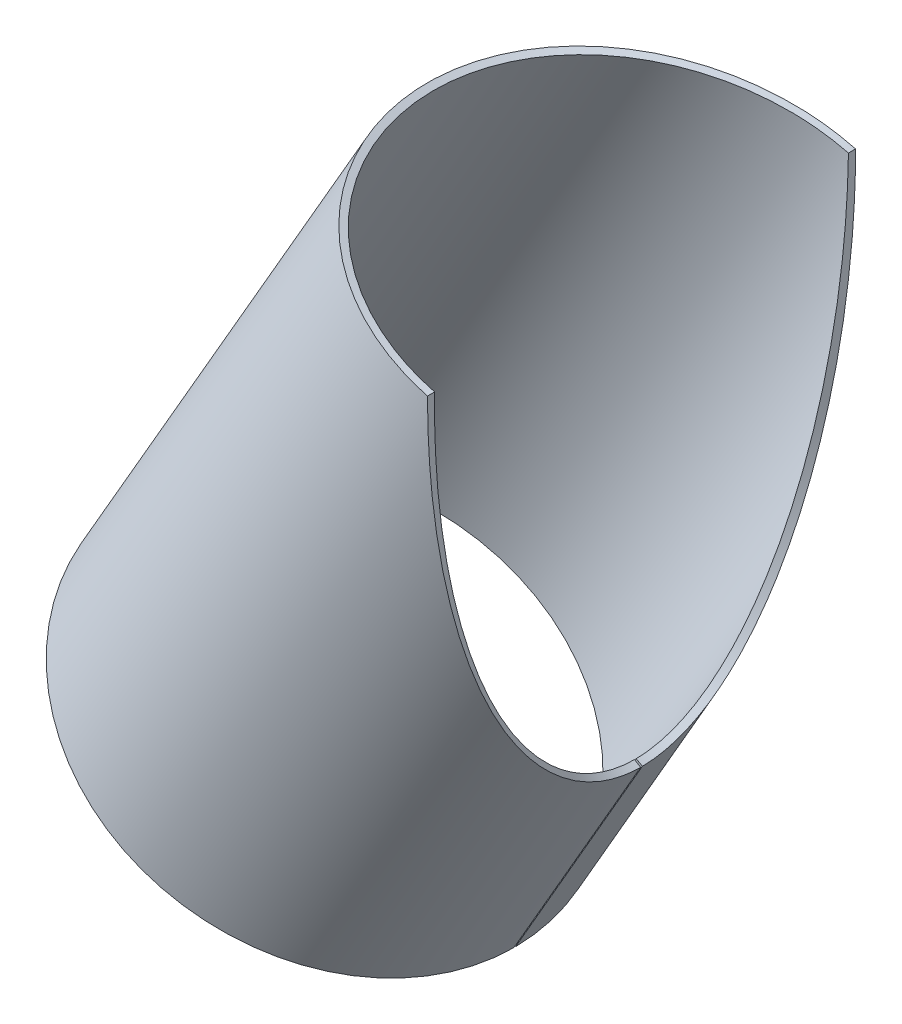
ISO-10303-21;
HEADER;
FILE_DESCRIPTION(('STEP AP214'),'2;1');
FILE_NAME('part.step','',(''),(''),'','','');
FILE_SCHEMA(('AUTOMOTIVE_DESIGN { 1 0 10303 214 1 1 1 1 }'));
ENDSEC;
DATA;
#1=APPLICATION_CONTEXT('core data for automotive mechanical design processes');
#2=APPLICATION_PROTOCOL_DEFINITION('international standard','automotive_design',2000,#1);
#3=PRODUCT_CONTEXT('',#1,'mechanical');
#4=PRODUCT('Part','Part','',(#3));
#5=PRODUCT_RELATED_PRODUCT_CATEGORY('part','',(#4));
#6=PRODUCT_DEFINITION_FORMATION('','',#4);
#7=PRODUCT_DEFINITION_CONTEXT('part definition',#1,'design');
#8=PRODUCT_DEFINITION('design','',#6,#7);
#9=PRODUCT_DEFINITION_SHAPE('','',#8);
#10=(LENGTH_UNIT() NAMED_UNIT(*) SI_UNIT(.MILLI.,.METRE.));
#11=(NAMED_UNIT(*) PLANE_ANGLE_UNIT() SI_UNIT($,.RADIAN.));
#12=(NAMED_UNIT(*) SI_UNIT($,.STERADIAN.) SOLID_ANGLE_UNIT());
#13=UNCERTAINTY_MEASURE_WITH_UNIT(LENGTH_MEASURE(1.E-05),#10,'distance_accuracy_value','');
#14=(GEOMETRIC_REPRESENTATION_CONTEXT(3) GLOBAL_UNCERTAINTY_ASSIGNED_CONTEXT((#13)) GLOBAL_UNIT_ASSIGNED_CONTEXT((#10,
#11,#12)) REPRESENTATION_CONTEXT('',''));
#15=CARTESIAN_POINT('',(0.,0.,0.));
#16=DIRECTION('',(0.,0.,1.));
#17=DIRECTION('',(1.,0.,0.));
#18=AXIS2_PLACEMENT_3D('',#15,#16,#17);
#19=CARTESIAN_POINT('',(-4.41487124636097E-13,-239.997916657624,0.499999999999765));
#20=CARTESIAN_POINT('',(0.000429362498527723,-239.994529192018,0.817251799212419));
#21=CARTESIAN_POINT('',(0.000230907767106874,-239.990063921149,1.09666906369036));
#22=CARTESIAN_POINT('',(-4.84814495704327E-05,-239.979770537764,1.57983498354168));
#23=CARTESIAN_POINT('',(1.12661219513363E-06,-239.974071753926,1.77559699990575));
#24=CARTESIAN_POINT('',(1.79829085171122E-05,-239.953813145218,2.38855224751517));
#25=CARTESIAN_POINT('',(-4.57601376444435E-06,-239.936498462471,2.78938708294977));
#26=CARTESIAN_POINT('',(-3.43189262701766E-06,-239.872587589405,3.99103444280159));
#27=CARTESIAN_POINT('',(-6.65102760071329E-06,-239.81395450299,4.79168062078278));
#28=CARTESIAN_POINT('',(-2.93398577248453E-06,-239.589913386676,7.19284515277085));
#29=CARTESIAN_POINT('',(-5.49739444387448E-06,-239.376346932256,8.792991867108));
#30=CARTESIAN_POINT('',(-2.17681973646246E-05,-238.542717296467,13.5884229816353));
#31=CARTESIAN_POINT('',(-1.85930873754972E-05,-237.729737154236,16.7784937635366));
#32=CARTESIAN_POINT('',(7.37499353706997E-05,-235.587571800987,23.1296338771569));
#33=CARTESIAN_POINT('',(7.39872431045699E-05,-234.257679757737,26.2927806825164));
#34=CARTESIAN_POINT('',(-5.79147039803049E-05,-231.08025355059,32.5727056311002));
#35=CARTESIAN_POINT('',(5.01731696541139E-05,-229.233999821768,35.6872417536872));
#36=CARTESIAN_POINT('',(0.000256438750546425,-225.016474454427,41.8627810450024));
#37=CARTESIAN_POINT('',(0.000158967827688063,-222.645341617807,44.9232105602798));
#38=CARTESIAN_POINT('',(-9.42814443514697E-05,-217.378533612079,50.9659059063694));
#39=CARTESIAN_POINT('',(-6.36907129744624E-05,-214.481161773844,53.950264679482));
#40=CARTESIAN_POINT('',(-5.96364358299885E-05,-204.977745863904,62.7748929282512));
#41=CARTESIAN_POINT('',(4.94692985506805E-05,-197.573525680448,68.4773874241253));
#42=CARTESIAN_POINT('',(2.75339560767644E-05,-184.769811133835,76.661732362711));
#43=CARTESIAN_POINT('',(0.000202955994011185,-180.207345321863,79.3344198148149));
#44=CARTESIAN_POINT('',(-7.76610891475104E-05,-170.492716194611,84.532381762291));
#45=CARTESIAN_POINT('',(0.000484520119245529,-165.318108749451,87.0689081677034));
#46=CARTESIAN_POINT('',(0.00061249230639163,-154.319761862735,91.9774664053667));
#47=CARTESIAN_POINT('',(5.8561192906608E-05,-148.498098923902,94.3484433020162));
#48=CARTESIAN_POINT('',(-2.41759080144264E-05,-139.282837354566,97.7431078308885));
#49=CARTESIAN_POINT('',(0.000216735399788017,-136.117544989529,98.8525331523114));
#50=CARTESIAN_POINT('',(0.000574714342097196,-129.58443517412,101.023509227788));
#51=CARTESIAN_POINT('',(0.000675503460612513,-126.219018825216,102.084179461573));
#52=CARTESIAN_POINT('',(0.000545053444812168,-119.2903618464,104.14633837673));
#53=CARTESIAN_POINT('',(0.000311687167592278,-115.72711998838,105.147825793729));
#54=CARTESIAN_POINT('',(5.53218585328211E-05,-110.234086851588,106.598209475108));
#55=CARTESIAN_POINT('',(-1.51955598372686E-05,-108.380497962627,107.072507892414));
#56=CARTESIAN_POINT('',(3.3966612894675E-05,-104.614674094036,108.004828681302));
#57=CARTESIAN_POINT('',(0.000160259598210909,-102.695944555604,108.464420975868));
#58=CARTESIAN_POINT('',(0.000822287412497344,-92.9229328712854,110.724035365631));
#59=CARTESIAN_POINT('',(0.00054670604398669,-84.5300373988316,112.409722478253));
#60=CARTESIAN_POINT('',(-2.19931781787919E-06,-73.3212734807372,114.268948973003));
#61=CARTESIAN_POINT('',(-1.91830438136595E-05,-71.0504541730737,114.627407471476));
#62=CARTESIAN_POINT('',(3.17949540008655E-05,-66.3829675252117,115.324787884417));
#63=CARTESIAN_POINT('',(6.84129558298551E-05,-63.9905253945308,115.662903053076));
#64=CARTESIAN_POINT('',(6.55576099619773E-05,-59.0881867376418,116.313159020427));
#65=CARTESIAN_POINT('',(2.51679960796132E-05,-56.578289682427,116.625299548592));
#66=CARTESIAN_POINT('',(-1.16630138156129E-05,-51.4411104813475,117.218560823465));
#67=CARTESIAN_POINT('',(5.69380082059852E-05,-48.777610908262,117.503879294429));
#68=CARTESIAN_POINT('',(8.02178508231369E-05,-43.2564519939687,118.043190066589));
#69=CARTESIAN_POINT('',(3.04599239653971E-05,-40.3994824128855,118.297102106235));
#70=CARTESIAN_POINT('',(1.04737288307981E-06,-36.7078460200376,118.58867215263));
#71=CARTESIAN_POINT('',(-3.257488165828E-06,-35.9660520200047,118.645508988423));
#72=CARTESIAN_POINT('',(1.16494283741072E-05,-34.4545487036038,118.757595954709));
#73=CARTESIAN_POINT('',(2.84380323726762E-05,-33.6850961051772,118.812810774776));
#74=CARTESIAN_POINT('',(8.25643470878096E-05,-31.3356214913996,118.975386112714));
#75=CARTESIAN_POINT('',(0.000120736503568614,-29.7144809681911,119.079684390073));
#76=CARTESIAN_POINT('',(0.000135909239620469,-26.3625139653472,119.276834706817));
#77=CARTESIAN_POINT('',(0.000112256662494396,-24.6316871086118,119.369686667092));
#78=CARTESIAN_POINT('',(5.70520289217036E-05,-21.9531974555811,119.497758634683));
#79=CARTESIAN_POINT('',(3.62168706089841E-05,-21.0466598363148,119.53857992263));
#80=CARTESIAN_POINT('',(1.3043094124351E-05,-19.6662985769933,119.596664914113));
#81=CARTESIAN_POINT('',(6.72642538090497E-06,-19.2027523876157,119.615501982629));
#82=CARTESIAN_POINT('',(-3.70959053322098E-07,-18.2688100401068,119.652068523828));
#83=CARTESIAN_POINT('',(-4.51027900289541E-06,-17.8048806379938,119.669581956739));
#84=CARTESIAN_POINT('',(0.000165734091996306,-13.3263745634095,119.831473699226));
#85=CARTESIAN_POINT('',(2.02966978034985E-06,-7.55756633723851,119.999999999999));
#86=CARTESIAN_POINT('',(-1.36470034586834E-13,-1.28502448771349E-12,119.999999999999));
#87=CARTESIAN_POINT('',(-3.46407154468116,-237.99793401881,0.483333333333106));
#88=CARTESIAN_POINT('',(-3.46360402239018,-237.99456858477,0.790010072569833));
#89=CARTESIAN_POINT('',(-3.46373306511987,-237.99014338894,1.06011342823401));
#90=CARTESIAN_POINT('',(-3.46385689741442,-237.979939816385,1.52717381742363));
#91=CARTESIAN_POINT('',(-3.46372627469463,-237.974287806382,1.71641043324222));
#92=CARTESIAN_POINT('',(-3.46341743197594,-237.954197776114,2.30893383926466));
#93=CARTESIAN_POINT('',(-3.46318951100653,-237.937027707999,2.69640751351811));
#94=CARTESIAN_POINT('',(-3.46226592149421,-237.873649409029,3.85799996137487));
#95=CARTESIAN_POINT('',(-3.46142276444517,-237.815504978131,4.63195793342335));
#96=CARTESIAN_POINT('',(-3.45818538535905,-237.593330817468,6.95308364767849));
#97=CARTESIAN_POINT('',(-3.45510531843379,-237.381544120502,8.4998921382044));
#98=CARTESIAN_POINT('',(-3.44308877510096,-236.554861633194,13.1354755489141));
#99=CARTESIAN_POINT('',(-3.43135132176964,-235.748656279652,16.2192106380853));
#100=CARTESIAN_POINT('',(-3.40034179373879,-233.624340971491,22.3586460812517));
#101=CARTESIAN_POINT('',(-3.38114622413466,-232.305531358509,25.4163546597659));
#102=CARTESIAN_POINT('',(-3.3354126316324,-229.154585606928,31.4869487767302));
#103=CARTESIAN_POINT('',(-3.30865886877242,-227.323715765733,34.4976670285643));
#104=CARTESIAN_POINT('',(-3.24758302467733,-223.141333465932,40.467355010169));
#105=CARTESIAN_POINT('',(-3.21345370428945,-220.789961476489,43.4257702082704));
#106=CARTESIAN_POINT('',(-3.13768079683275,-215.567047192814,49.2670423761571));
#107=CARTESIAN_POINT('',(-3.09583101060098,-212.693819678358,52.1519225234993));
#108=CARTESIAN_POINT('',(-2.95865706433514,-203.269598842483,60.6823964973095));
#109=CARTESIAN_POINT('',(-2.85167997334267,-195.927078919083,66.1948078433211));
#110=CARTESIAN_POINT('',(-2.66689565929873,-183.230062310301,74.106341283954));
#111=CARTESIAN_POINT('',(-2.60087110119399,-178.705614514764,76.6899391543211));
#112=CARTESIAN_POINT('',(-2.46092610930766,-169.071944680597,81.714635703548));
#113=CARTESIAN_POINT('',(-2.38568895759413,-163.94045084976,84.1666112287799));
#114=CARTESIAN_POINT('',(-2.2268167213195,-153.033755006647,88.9115508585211));
#115=CARTESIAN_POINT('',(-2.14332833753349,-147.260613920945,91.203495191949));
#116=CARTESIAN_POINT('',(-2.01039816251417,-138.122147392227,94.4850042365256));
#117=CARTESIAN_POINT('',(-1.9644762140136,-134.98322898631,95.557448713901));
#118=CARTESIAN_POINT('',(-1.86982986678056,-128.504556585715,97.6560589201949));
#119=CARTESIAN_POINT('',(-1.82115599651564,-125.167183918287,98.6813734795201));
#120=CARTESIAN_POINT('',(-1.72127663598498,-118.296267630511,100.674793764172));
#121=CARTESIAN_POINT('',(-1.67007320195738,-114.762722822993,101.642898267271));
#122=CARTESIAN_POINT('',(-1.59103805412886,-109.315468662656,103.044935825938));
#123=CARTESIAN_POINT('',(-1.56435255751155,-107.477327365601,103.503424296));
#124=CARTESIAN_POINT('',(-1.50994963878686,-103.742884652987,104.404667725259));
#125=CARTESIAN_POINT('',(-1.48213202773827,-101.840142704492,104.848940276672));
#126=CARTESIAN_POINT('',(-1.34042527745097,-92.1485632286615,107.033234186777));
#127=CARTESIAN_POINT('',(-1.21955295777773,-83.825612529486,108.662731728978));
#128=CARTESIAN_POINT('',(-1.05830356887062,-72.7102629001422,110.459984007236));
#129=CARTESIAN_POINT('',(-1.02554367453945,-70.4583673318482,110.806493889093));
#130=CARTESIAN_POINT('',(-0.958124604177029,-65.8297756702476,111.48062828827));
#131=CARTESIAN_POINT('',(-0.923556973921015,-63.4572700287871,111.807472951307));
#132=CARTESIAN_POINT('',(-0.852800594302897,-58.5957842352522,112.436053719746));
#133=CARTESIAN_POINT('',(-0.816612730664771,-56.1068035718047,112.737789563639));
#134=CARTESIAN_POINT('',(-0.742499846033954,-51.0124347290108,113.311275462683));
#135=CARTESIAN_POINT('',(-0.703988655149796,-48.3711299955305,113.587083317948));
#136=CARTESIAN_POINT('',(-0.624274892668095,-42.8959804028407,114.108417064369));
#137=CARTESIAN_POINT('',(-0.583086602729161,-40.0628196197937,114.353865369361));
#138=CARTESIAN_POINT('',(-0.529831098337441,-36.4019472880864,114.635716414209));
#139=CARTESIAN_POINT('',(-0.519128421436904,-35.6663349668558,114.690658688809));
#140=CARTESIAN_POINT('',(-0.497297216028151,-34.1674272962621,114.799009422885));
#141=CARTESIAN_POINT('',(-0.486174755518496,-33.4043865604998,114.85238374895));
#142=CARTESIAN_POINT('',(-0.452210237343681,-31.0744901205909,115.009539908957));
#143=CARTESIAN_POINT('',(-0.428773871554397,-29.4668585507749,115.110361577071));
#144=CARTESIAN_POINT('',(-0.380377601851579,-26.1428243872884,115.30094021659));
#145=CARTESIAN_POINT('',(-0.355418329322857,-24.426421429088,115.390697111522));
#146=CARTESIAN_POINT('',(-0.316811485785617,-21.7702533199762,115.514500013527));
#147=CARTESIAN_POINT('',(-0.303747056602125,-20.8712704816,115.553960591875));
#148=CARTESIAN_POINT('',(-0.283845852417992,-19.5024125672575,115.610109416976));
#149=CARTESIAN_POINT('',(-0.277161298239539,-19.0427293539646,115.628318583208));
#150=CARTESIAN_POINT('',(-0.263687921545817,-18.1165699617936,115.663666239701));
#151=CARTESIAN_POINT('',(-0.256995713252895,-17.6565066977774,115.680595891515));
#152=CARTESIAN_POINT('',(-0.192188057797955,-13.2153190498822,115.837091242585));
#153=CARTESIAN_POINT('',(-0.109081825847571,-7.49456809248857,115.999999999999));
#154=CARTESIAN_POINT('',(-1.47955100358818E-13,-1.28119613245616E-12,115.999999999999));
#155=B_SPLINE_SURFACE_WITH_KNOTS('',1,3,((#19,#20,#21,#22,#23,#24,#25,#26,#27,#28,#29,#30,#31,
#32,#33,#34,#35,#36,#37,#38,#39,#40,#41,#42,#43,#44,#45,#46,#47,#48,#49,#50,#51,#52,#53,#54,#55,
#56,#57,#58,#59,#60,#61,#62,#63,#64,#65,#66,#67,#68,#69,#70,#71,#72,#73,#74,#75,#76,#77,#78,#79,
#80,#81,#82,#83,#84,#85,#86),(#87,#88,#89,#90,#91,#92,#93,#94,#95,#96,#97,#98,#99,#100,#101,
#102,#103,#104,#105,#106,#107,#108,#109,#110,#111,#112,#113,#114,#115,#116,#117,#118,#119,#120,
#121,#122,#123,#124,#125,#126,#127,#128,#129,#130,#131,#132,#133,#134,#135,#136,#137,#138,#139,
#140,#141,#142,#143,#144,#145,#146,#147,#148,#149,#150,#151,#152,#153,#154)),.UNSPECIFIED.,.F.,
.F.,.F.,(2,2),(4,2,2,2,2,2,2,2,2,2,2,2,2,2,2,2,2,2,2,2,2,2,2,2,2,2,2,2,2,2,2,2,2,4),(0.,1.),(0.,
0.00390625,0.0078125,0.015625,0.03125,0.0625,0.125,0.1875,0.25,0.3125,0.375,0.5,0.5625,0.625,
0.6875,0.71875,0.75,0.78125,0.796875,0.8125,0.875,0.890625,0.90625,0.921875,0.9375,0.953125,
0.95703125,0.9609375,0.96875,0.9765625,0.98046875,0.982421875,0.984375,1.),.UNSPECIFIED.);
#156=CARTESIAN_POINT('',(-4.41487124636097E-13,-239.997916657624,0.499999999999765));
#157=CARTESIAN_POINT('',(-3.46407154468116,-237.99793401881,0.483333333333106));
#158=B_SPLINE_CURVE_WITH_KNOTS('',1,(#156,#157),.UNSPECIFIED.,.F.,.F.,(2,2),(0.,1.),.UNSPECIFIED.);
#159=CARTESIAN_POINT('',(-3.46407154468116,-237.99793401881,0.483333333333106));
#160=VERTEX_POINT('',#159);
#161=CARTESIAN_POINT('',(-4.30211422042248E-13,-239.997916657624,0.499999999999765));
#162=VERTEX_POINT('',#161);
#163=EDGE_CURVE('E13',#160,#162,#158,.F.);
#164=CARTESIAN_POINT('',(-3.46407154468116,-237.99793401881,0.483333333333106));
#165=CARTESIAN_POINT('',(-3.46360402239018,-237.99456858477,0.790010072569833));
#166=CARTESIAN_POINT('',(-3.46373306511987,-237.99014338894,1.06011342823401));
#167=CARTESIAN_POINT('',(-3.46385689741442,-237.979939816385,1.52717381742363));
#168=CARTESIAN_POINT('',(-3.46372627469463,-237.974287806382,1.71641043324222));
#169=CARTESIAN_POINT('',(-3.46341743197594,-237.954197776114,2.30893383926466));
#170=CARTESIAN_POINT('',(-3.46318951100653,-237.937027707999,2.69640751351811));
#171=CARTESIAN_POINT('',(-3.46226592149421,-237.873649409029,3.85799996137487));
#172=CARTESIAN_POINT('',(-3.46142276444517,-237.815504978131,4.63195793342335));
#173=CARTESIAN_POINT('',(-3.45818538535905,-237.593330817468,6.95308364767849));
#174=CARTESIAN_POINT('',(-3.45510531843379,-237.381544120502,8.4998921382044));
#175=CARTESIAN_POINT('',(-3.44308877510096,-236.554861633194,13.1354755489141));
#176=CARTESIAN_POINT('',(-3.43135132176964,-235.748656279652,16.2192106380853));
#177=CARTESIAN_POINT('',(-3.40034179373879,-233.624340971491,22.3586460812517));
#178=CARTESIAN_POINT('',(-3.38114622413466,-232.305531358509,25.4163546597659));
#179=CARTESIAN_POINT('',(-3.3354126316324,-229.154585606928,31.4869487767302));
#180=CARTESIAN_POINT('',(-3.30865886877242,-227.323715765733,34.4976670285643));
#181=CARTESIAN_POINT('',(-3.24758302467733,-223.141333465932,40.467355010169));
#182=CARTESIAN_POINT('',(-3.21345370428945,-220.789961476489,43.4257702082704));
#183=CARTESIAN_POINT('',(-3.13768079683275,-215.567047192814,49.2670423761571));
#184=CARTESIAN_POINT('',(-3.09583101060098,-212.693819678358,52.1519225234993));
#185=CARTESIAN_POINT('',(-2.95865706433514,-203.269598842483,60.6823964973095));
#186=CARTESIAN_POINT('',(-2.85167997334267,-195.927078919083,66.1948078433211));
#187=CARTESIAN_POINT('',(-2.66689565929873,-183.230062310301,74.106341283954));
#188=CARTESIAN_POINT('',(-2.60087110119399,-178.705614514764,76.6899391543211));
#189=CARTESIAN_POINT('',(-2.46092610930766,-169.071944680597,81.714635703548));
#190=CARTESIAN_POINT('',(-2.38568895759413,-163.94045084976,84.1666112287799));
#191=CARTESIAN_POINT('',(-2.2268167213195,-153.033755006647,88.9115508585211));
#192=CARTESIAN_POINT('',(-2.14332833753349,-147.260613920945,91.203495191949));
#193=CARTESIAN_POINT('',(-2.01039816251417,-138.122147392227,94.4850042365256));
#194=CARTESIAN_POINT('',(-1.9644762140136,-134.98322898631,95.557448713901));
#195=CARTESIAN_POINT('',(-1.86982986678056,-128.504556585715,97.6560589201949));
#196=CARTESIAN_POINT('',(-1.82115599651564,-125.167183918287,98.6813734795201));
#197=CARTESIAN_POINT('',(-1.72127663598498,-118.296267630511,100.674793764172));
#198=CARTESIAN_POINT('',(-1.67007320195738,-114.762722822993,101.642898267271));
#199=CARTESIAN_POINT('',(-1.59103805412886,-109.315468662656,103.044935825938));
#200=CARTESIAN_POINT('',(-1.56435255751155,-107.477327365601,103.503424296));
#201=CARTESIAN_POINT('',(-1.50994963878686,-103.742884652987,104.404667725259));
#202=CARTESIAN_POINT('',(-1.48213202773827,-101.840142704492,104.848940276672));
#203=CARTESIAN_POINT('',(-1.34042527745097,-92.1485632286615,107.033234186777));
#204=CARTESIAN_POINT('',(-1.21955295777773,-83.825612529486,108.662731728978));
#205=CARTESIAN_POINT('',(-1.05830356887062,-72.7102629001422,110.459984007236));
#206=CARTESIAN_POINT('',(-1.02554367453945,-70.4583673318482,110.806493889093));
#207=CARTESIAN_POINT('',(-0.958124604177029,-65.8297756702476,111.48062828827));
#208=CARTESIAN_POINT('',(-0.923556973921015,-63.4572700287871,111.807472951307));
#209=CARTESIAN_POINT('',(-0.852800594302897,-58.5957842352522,112.436053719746));
#210=CARTESIAN_POINT('',(-0.816612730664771,-56.1068035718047,112.737789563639));
#211=CARTESIAN_POINT('',(-0.742499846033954,-51.0124347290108,113.311275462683));
#212=CARTESIAN_POINT('',(-0.703988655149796,-48.3711299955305,113.587083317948));
#213=CARTESIAN_POINT('',(-0.624274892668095,-42.8959804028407,114.108417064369));
#214=CARTESIAN_POINT('',(-0.583086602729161,-40.0628196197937,114.353865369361));
#215=CARTESIAN_POINT('',(-0.529831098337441,-36.4019472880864,114.635716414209));
#216=CARTESIAN_POINT('',(-0.519128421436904,-35.6663349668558,114.690658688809));
#217=CARTESIAN_POINT('',(-0.497297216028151,-34.1674272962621,114.799009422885));
#218=CARTESIAN_POINT('',(-0.486174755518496,-33.4043865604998,114.85238374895));
#219=CARTESIAN_POINT('',(-0.452210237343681,-31.0744901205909,115.009539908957));
#220=CARTESIAN_POINT('',(-0.428773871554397,-29.4668585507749,115.110361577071));
#221=CARTESIAN_POINT('',(-0.380377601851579,-26.1428243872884,115.30094021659));
#222=CARTESIAN_POINT('',(-0.355418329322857,-24.426421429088,115.390697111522));
#223=CARTESIAN_POINT('',(-0.316811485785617,-21.7702533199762,115.514500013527));
#224=CARTESIAN_POINT('',(-0.303747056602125,-20.8712704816,115.553960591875));
#225=CARTESIAN_POINT('',(-0.283845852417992,-19.5024125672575,115.610109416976));
#226=CARTESIAN_POINT('',(-0.277161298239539,-19.0427293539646,115.628318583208));
#227=CARTESIAN_POINT('',(-0.263687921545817,-18.1165699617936,115.663666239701));
#228=CARTESIAN_POINT('',(-0.256995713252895,-17.6565066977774,115.680595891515));
#229=CARTESIAN_POINT('',(-0.192188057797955,-13.2153190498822,115.837091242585));
#230=CARTESIAN_POINT('',(-0.109081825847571,-7.49456809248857,115.999999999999));
#231=CARTESIAN_POINT('',(-1.47955100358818E-13,-1.28119613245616E-12,115.999999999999));
#232=B_SPLINE_CURVE_WITH_KNOTS('',3,(#164,#165,#166,#167,#168,#169,#170,#171,#172,#173,#174,
#175,#176,#177,#178,#179,#180,#181,#182,#183,#184,#185,#186,#187,#188,#189,#190,#191,#192,#193,
#194,#195,#196,#197,#198,#199,#200,#201,#202,#203,#204,#205,#206,#207,#208,#209,#210,#211,#212,
#213,#214,#215,#216,#217,#218,#219,#220,#221,#222,#223,#224,#225,#226,#227,#228,#229,#230,#231),
.UNSPECIFIED.,.F.,.F.,(4,2,2,2,2,2,2,2,2,2,2,2,2,2,2,2,2,2,2,2,2,2,2,2,2,2,2,2,2,2,2,2,2,4),(0.,
0.00390625,0.0078125,0.015625,0.03125,0.0625,0.125,0.1875,0.25,0.3125,0.375,0.5,0.5625,0.625,
0.6875,0.71875,0.75,0.78125,0.796875,0.8125,0.875,0.890625,0.90625,0.921875,0.9375,0.953125,
0.95703125,0.9609375,0.96875,0.9765625,0.98046875,0.982421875,0.984375,1.),.UNSPECIFIED.);
#233=CARTESIAN_POINT('',(1.29600655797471E-13,-8.37106922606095E-13,115.999999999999));
#234=VERTEX_POINT('',#233);
#235=EDGE_CURVE('E201',#160,#234,#232,.T.);
#236=CARTESIAN_POINT('',(-1.47955100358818E-13,-1.28119613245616E-12,115.999999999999));
#237=CARTESIAN_POINT('',(-1.36470034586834E-13,-1.28502448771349E-12,119.999999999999));
#238=B_SPLINE_CURVE_WITH_KNOTS('',1,(#236,#237),.UNSPECIFIED.,.F.,.F.,(2,2),(0.,1.),.UNSPECIFIED.);
#239=CARTESIAN_POINT('',(0.,-5.01211356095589E-07,119.999999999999));
#240=VERTEX_POINT('',#239);
#241=EDGE_CURVE('E51',#234,#240,#238,.T.);
#242=CARTESIAN_POINT('',(-1.36470034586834E-13,-1.28502448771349E-12,119.999999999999));
#243=CARTESIAN_POINT('',(2.02966978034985E-06,-7.55756633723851,119.999999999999));
#244=CARTESIAN_POINT('',(0.000165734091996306,-13.3263745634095,119.831473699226));
#245=CARTESIAN_POINT('',(-4.51027900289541E-06,-17.8048806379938,119.669581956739));
#246=CARTESIAN_POINT('',(-3.70959053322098E-07,-18.2688100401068,119.652068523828));
#247=CARTESIAN_POINT('',(6.72642538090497E-06,-19.2027523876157,119.615501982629));
#248=CARTESIAN_POINT('',(1.3043094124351E-05,-19.6662985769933,119.596664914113));
#249=CARTESIAN_POINT('',(3.62168706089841E-05,-21.0466598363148,119.53857992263));
#250=CARTESIAN_POINT('',(5.70520289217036E-05,-21.9531974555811,119.497758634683));
#251=CARTESIAN_POINT('',(0.000112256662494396,-24.6316871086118,119.369686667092));
#252=CARTESIAN_POINT('',(0.000135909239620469,-26.3625139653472,119.276834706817));
#253=CARTESIAN_POINT('',(0.000120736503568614,-29.7144809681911,119.079684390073));
#254=CARTESIAN_POINT('',(8.25643470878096E-05,-31.3356214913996,118.975386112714));
#255=CARTESIAN_POINT('',(2.84380323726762E-05,-33.6850961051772,118.812810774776));
#256=CARTESIAN_POINT('',(1.16494283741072E-05,-34.4545487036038,118.757595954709));
#257=CARTESIAN_POINT('',(-3.257488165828E-06,-35.9660520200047,118.645508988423));
#258=CARTESIAN_POINT('',(1.04737288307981E-06,-36.7078460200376,118.58867215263));
#259=CARTESIAN_POINT('',(3.04599239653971E-05,-40.3994824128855,118.297102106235));
#260=CARTESIAN_POINT('',(8.02178508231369E-05,-43.2564519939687,118.043190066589));
#261=CARTESIAN_POINT('',(5.69380082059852E-05,-48.777610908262,117.503879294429));
#262=CARTESIAN_POINT('',(-1.16630138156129E-05,-51.4411104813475,117.218560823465));
#263=CARTESIAN_POINT('',(2.51679960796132E-05,-56.578289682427,116.625299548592));
#264=CARTESIAN_POINT('',(6.55576099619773E-05,-59.0881867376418,116.313159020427));
#265=CARTESIAN_POINT('',(6.84129558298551E-05,-63.9905253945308,115.662903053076));
#266=CARTESIAN_POINT('',(3.17949540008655E-05,-66.3829675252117,115.324787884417));
#267=CARTESIAN_POINT('',(-1.91830438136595E-05,-71.0504541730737,114.627407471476));
#268=CARTESIAN_POINT('',(-2.19931781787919E-06,-73.3212734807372,114.268948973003));
#269=CARTESIAN_POINT('',(0.00054670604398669,-84.5300373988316,112.409722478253));
#270=CARTESIAN_POINT('',(0.000822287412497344,-92.9229328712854,110.724035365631));
#271=CARTESIAN_POINT('',(0.000160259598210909,-102.695944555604,108.464420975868));
#272=CARTESIAN_POINT('',(3.3966612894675E-05,-104.614674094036,108.004828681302));
#273=CARTESIAN_POINT('',(-1.51955598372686E-05,-108.380497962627,107.072507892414));
#274=CARTESIAN_POINT('',(5.53218585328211E-05,-110.234086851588,106.598209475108));
#275=CARTESIAN_POINT('',(0.000311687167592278,-115.72711998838,105.147825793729));
#276=CARTESIAN_POINT('',(0.000545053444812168,-119.2903618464,104.14633837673));
#277=CARTESIAN_POINT('',(0.000675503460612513,-126.219018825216,102.084179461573));
#278=CARTESIAN_POINT('',(0.000574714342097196,-129.58443517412,101.023509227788));
#279=CARTESIAN_POINT('',(0.000216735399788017,-136.117544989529,98.8525331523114));
#280=CARTESIAN_POINT('',(-2.41759080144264E-05,-139.282837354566,97.7431078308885));
#281=CARTESIAN_POINT('',(5.8561192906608E-05,-148.498098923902,94.3484433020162));
#282=CARTESIAN_POINT('',(0.00061249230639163,-154.319761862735,91.9774664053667));
#283=CARTESIAN_POINT('',(0.000484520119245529,-165.318108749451,87.0689081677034));
#284=CARTESIAN_POINT('',(-7.76610891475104E-05,-170.492716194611,84.532381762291));
#285=CARTESIAN_POINT('',(0.000202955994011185,-180.207345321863,79.3344198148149));
#286=CARTESIAN_POINT('',(2.75339560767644E-05,-184.769811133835,76.661732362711));
#287=CARTESIAN_POINT('',(4.94692985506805E-05,-197.573525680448,68.4773874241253));
#288=CARTESIAN_POINT('',(-5.96364358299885E-05,-204.977745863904,62.7748929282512));
#289=CARTESIAN_POINT('',(-6.36907129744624E-05,-214.481161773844,53.950264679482));
#290=CARTESIAN_POINT('',(-9.42814443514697E-05,-217.378533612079,50.9659059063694));
#291=CARTESIAN_POINT('',(0.000158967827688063,-222.645341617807,44.9232105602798));
#292=CARTESIAN_POINT('',(0.000256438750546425,-225.016474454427,41.8627810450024));
#293=CARTESIAN_POINT('',(5.01731696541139E-05,-229.233999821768,35.6872417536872));
#294=CARTESIAN_POINT('',(-5.79147039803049E-05,-231.08025355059,32.5727056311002));
#295=CARTESIAN_POINT('',(7.39872431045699E-05,-234.257679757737,26.2927806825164));
#296=CARTESIAN_POINT('',(7.37499353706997E-05,-235.587571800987,23.1296338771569));
#297=CARTESIAN_POINT('',(-1.85930873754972E-05,-237.729737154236,16.7784937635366));
#298=CARTESIAN_POINT('',(-2.17681973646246E-05,-238.542717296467,13.5884229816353));
#299=CARTESIAN_POINT('',(-5.49739444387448E-06,-239.376346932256,8.792991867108));
#300=CARTESIAN_POINT('',(-2.93398577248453E-06,-239.589913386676,7.19284515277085));
#301=CARTESIAN_POINT('',(-6.65102760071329E-06,-239.81395450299,4.79168062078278));
#302=CARTESIAN_POINT('',(-3.43189262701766E-06,-239.872587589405,3.99103444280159));
#303=CARTESIAN_POINT('',(-4.57601376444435E-06,-239.936498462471,2.78938708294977));
#304=CARTESIAN_POINT('',(1.79829085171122E-05,-239.953813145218,2.38855224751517));
#305=CARTESIAN_POINT('',(1.12661219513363E-06,-239.974071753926,1.77559699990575));
#306=CARTESIAN_POINT('',(-4.84814495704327E-05,-239.979770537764,1.57983498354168));
#307=CARTESIAN_POINT('',(0.000230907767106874,-239.990063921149,1.09666906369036));
#308=CARTESIAN_POINT('',(0.000429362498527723,-239.994529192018,0.817251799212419));
#309=CARTESIAN_POINT('',(-4.41487124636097E-13,-239.997916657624,0.499999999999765));
#310=B_SPLINE_CURVE_WITH_KNOTS('',3,(#242,#243,#244,#245,#246,#247,#248,#249,#250,#251,#252,
#253,#254,#255,#256,#257,#258,#259,#260,#261,#262,#263,#264,#265,#266,#267,#268,#269,#270,#271,
#272,#273,#274,#275,#276,#277,#278,#279,#280,#281,#282,#283,#284,#285,#286,#287,#288,#289,#290,
#291,#292,#293,#294,#295,#296,#297,#298,#299,#300,#301,#302,#303,#304,#305,#306,#307,#308,#309),
.UNSPECIFIED.,.F.,.F.,(4,2,2,2,2,2,2,2,2,2,2,2,2,2,2,2,2,2,2,2,2,2,2,2,2,2,2,2,2,2,2,2,2,4),(0.,
0.015625,0.017578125,0.01953125,0.0234375,0.03125,0.0390625,0.04296875,0.046875,0.0625,0.078125,
0.09375,0.109375,0.125,0.1875,0.203125,0.21875,0.25,0.28125,0.3125,0.375,0.4375,0.5,0.625,
0.6875,0.75,0.8125,0.875,0.9375,0.96875,0.984375,0.9921875,0.99609375,1.),.UNSPECIFIED.);
#311=EDGE_CURVE('E127',#162,#240,#310,.F.);
#312=ORIENTED_EDGE('',*,*,#163,.F.);
#313=ORIENTED_EDGE('',*,*,#235,.T.);
#314=ORIENTED_EDGE('',*,*,#241,.T.);
#315=ORIENTED_EDGE('',*,*,#311,.F.);
#316=EDGE_LOOP('',(#312,#313,#314,#315));
#317=FACE_BOUND('',#316,.T.);
#318=ADVANCED_FACE('F40',(#317),#155,.T.);
#319=CARTESIAN_POINT('',(1.41085721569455E-13,-8.40935277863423E-13,119.999999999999));
#320=CARTESIAN_POINT('',(-3.43065750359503,0.91924408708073,119.999999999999));
#321=CARTESIAN_POINT('',(-6.28647397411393,1.68477878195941,119.857007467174));
#322=CARTESIAN_POINT('',(-9.70625086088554,2.6008958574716,119.612263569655));
#323=CARTESIAN_POINT('',(-10.7019293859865,2.8675736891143,119.524906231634));
#324=CARTESIAN_POINT('',(-12.4080312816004,3.32472170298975,119.359856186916));
#325=CARTESIAN_POINT('',(-13.2432837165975,3.54854491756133,119.269831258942));
#326=CARTESIAN_POINT('',(-17.3302502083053,4.64373202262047,118.787624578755));
#327=CARTESIAN_POINT('',(-20.3131493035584,5.44289578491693,118.30018841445));
#328=CARTESIAN_POINT('',(-28.4080074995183,7.61189603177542,116.718550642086));
#329=CARTESIAN_POINT('',(-33.3914101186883,8.94805012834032,115.360853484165));
#330=CARTESIAN_POINT('',(-40.236968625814,10.7818592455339,113.078537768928));
#331=CARTESIAN_POINT('',(-42.4143186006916,11.3649685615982,112.276485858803));
#332=CARTESIAN_POINT('',(-45.5255120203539,12.1985020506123,111.034569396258));
#333=CARTESIAN_POINT('',(-46.5396323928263,12.4702693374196,110.613099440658));
#334=CARTESIAN_POINT('',(-48.5476056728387,13.00839164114,109.746621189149));
#335=CARTESIAN_POINT('',(-49.5378058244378,13.2737762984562,109.303048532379));
#336=CARTESIAN_POINT('',(-54.4195282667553,14.5821174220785,107.037508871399));
#337=CARTESIAN_POINT('',(-58.1026885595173,15.5690231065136,105.072865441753));
#338=CARTESIAN_POINT('',(-63.2940934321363,16.9597255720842,101.970161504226));
#339=CARTESIAN_POINT('',(-64.9658887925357,17.4075613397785,100.912068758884));
#340=CARTESIAN_POINT('',(-68.2146116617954,18.2780596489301,98.7450185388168));
#341=CARTESIAN_POINT('',(-69.7974345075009,18.7022547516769,97.631883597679));
#342=CARTESIAN_POINT('',(-74.4203938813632,19.9411621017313,94.2139865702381));
#343=CARTESIAN_POINT('',(-77.3348367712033,20.7220898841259,91.830848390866));
#344=CARTESIAN_POINT('',(-82.8286469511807,22.1939155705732,86.9080833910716));
#345=CARTESIAN_POINT('',(-85.4034067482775,22.8837873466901,84.3743267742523));
#346=CARTESIAN_POINT('',(-90.2727389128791,24.1887221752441,79.1428031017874));
#347=CARTESIAN_POINT('',(-92.5613965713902,24.8020257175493,76.4495325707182));
#348=CARTESIAN_POINT('',(-96.8461165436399,25.9499710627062,70.9435370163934));
#349=CARTESIAN_POINT('',(-98.8392225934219,26.4838646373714,68.1355641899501));
#350=CARTESIAN_POINT('',(-102.55143214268,27.4786346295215,62.4086694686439));
#351=CARTESIAN_POINT('',(-104.271606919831,27.9396681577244,59.4871286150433));
#352=CARTESIAN_POINT('',(-107.438915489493,28.7883504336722,53.5552507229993));
#353=CARTESIAN_POINT('',(-108.886055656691,29.1760028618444,50.5449209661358));
#354=CARTESIAN_POINT('',(-111.508374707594,29.8785463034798,44.4618490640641));
#355=CARTESIAN_POINT('',(-112.68674249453,30.1943916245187,41.3820139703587));
#356=CARTESIAN_POINT('',(-114.780972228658,30.7556431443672,35.1580617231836));
#357=CARTESIAN_POINT('',(-115.696090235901,31.0008354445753,32.0156792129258));
#358=CARTESIAN_POINT('',(-117.262433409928,31.4204113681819,25.6928991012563));
#359=CARTESIAN_POINT('',(-117.913392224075,31.594775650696,22.5150338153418));
#360=CARTESIAN_POINT('',(-119.477688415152,32.0140589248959,12.9243018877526));
#361=CARTESIAN_POINT('',(-119.999129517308,32.1536838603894,6.46206845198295));
#362=CARTESIAN_POINT('',(-120.000868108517,32.1541221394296,-6.42995923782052));
#363=CARTESIAN_POINT('',(-119.481155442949,32.0149786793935,-12.8926224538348));
#364=CARTESIAN_POINT('',(-117.919161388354,31.5963238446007,-22.484845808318));
#365=CARTESIAN_POINT('',(-117.268924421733,31.4221520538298,-25.6633111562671));
#366=CARTESIAN_POINT('',(-115.703929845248,31.0029422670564,-31.9873709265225));
#367=CARTESIAN_POINT('',(-114.789431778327,30.757919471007,-35.1304689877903));
#368=CARTESIAN_POINT('',(-112.696308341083,30.1969654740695,-41.3559863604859));
#369=CARTESIAN_POINT('',(-111.51841623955,29.8812424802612,-44.4366969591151));
#370=CARTESIAN_POINT('',(-108.896945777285,29.1789156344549,-50.5215012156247));
#371=CARTESIAN_POINT('',(-107.450104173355,28.7913476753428,-53.5328600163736));
#372=CARTESIAN_POINT('',(-104.283075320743,27.9427486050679,-59.4670695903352));
#373=CARTESIAN_POINT('',(-102.562881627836,27.4817137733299,-62.3899130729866));
#374=CARTESIAN_POINT('',(-98.8502566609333,26.4868206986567,-68.119620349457));
#375=CARTESIAN_POINT('',(-96.8568107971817,25.9528215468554,-70.9290090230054));
#376=CARTESIAN_POINT('',(-92.5712929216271,24.804652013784,-76.4376227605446));
#377=CARTESIAN_POINT('',(-90.2821524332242,24.1912189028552,-79.1321346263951));
#378=CARTESIAN_POINT('',(-85.4117028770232,22.8859992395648,-84.3659863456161));
#379=CARTESIAN_POINT('',(-82.8362904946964,22.1959723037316,-86.9008338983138));
#380=CARTESIAN_POINT('',(-77.341465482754,20.7238820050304,-91.8252968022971));
#381=CARTESIAN_POINT('',(-74.4266060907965,19.9428371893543,-94.2090969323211));
#382=CARTESIAN_POINT('',(-69.8032092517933,18.7038065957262,-97.627758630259));
#383=CARTESIAN_POINT('',(-68.2202717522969,18.2795791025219,-98.7411105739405));
#384=CARTESIAN_POINT('',(-64.9713896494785,17.4090378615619,-100.908529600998));
#385=CARTESIAN_POINT('',(-63.2995795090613,16.9611987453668,-101.966757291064));
#386=CARTESIAN_POINT('',(-58.108044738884,15.5704616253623,-105.06991125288));
#387=CARTESIAN_POINT('',(-54.4247850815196,14.5835287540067,-107.03484412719));
#388=CARTESIAN_POINT('',(-49.5429229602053,13.2751488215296,-109.300729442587));
#389=CARTESIAN_POINT('',(-48.5526941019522,13.0097561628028,-109.744370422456));
#390=CARTESIAN_POINT('',(-46.5446618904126,12.4716173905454,-110.610983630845));
#391=CARTESIAN_POINT('',(-45.5305018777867,12.1998390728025,-111.032523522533));
#392=CARTESIAN_POINT('',(-42.4193211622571,11.3663077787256,-112.274596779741));
#393=CARTESIAN_POINT('',(-40.2419434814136,10.783191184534,-113.076769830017));
#394=CARTESIAN_POINT('',(-33.3961863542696,8.94932998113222,-115.359479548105));
#395=CARTESIAN_POINT('',(-28.4124964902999,7.61310034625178,-116.717481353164));
#396=CARTESIAN_POINT('',(-20.3169575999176,5.4439154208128,-118.29954031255));
#397=CARTESIAN_POINT('',(-17.3339542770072,4.64472470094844,-118.787099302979));
#398=CARTESIAN_POINT('',(-13.2463201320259,3.54935867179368,-119.269495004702));
#399=CARTESIAN_POINT('',(-12.4109186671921,3.32549547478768,-119.359557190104));
#400=CARTESIAN_POINT('',(-10.704487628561,2.86825905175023,-119.524678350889));
#401=CARTESIAN_POINT('',(-9.70904393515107,2.60164397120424,-119.612038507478));
#402=CARTESIAN_POINT('',(-6.28876754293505,1.68539338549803,-119.856893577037));
#403=CARTESIAN_POINT('',(-3.4320762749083,0.919624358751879,-120.));
#404=CARTESIAN_POINT('',(3.69507125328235E-13,-9.72222188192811E-13,-119.999999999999));
#405=CARTESIAN_POINT('',(1.29600655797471E-13,-8.37106922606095E-13,115.999999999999));
#406=CARTESIAN_POINT('',(-3.33162080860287,0.8620658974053,115.999999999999));
#407=CARTESIAN_POINT('',(-6.10499443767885,1.58000152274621,115.861773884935));
#408=CARTESIAN_POINT('',(-9.42605389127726,2.43912406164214,115.625188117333));
#409=CARTESIAN_POINT('',(-10.3929912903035,2.68920819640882,115.54074269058));
#410=CARTESIAN_POINT('',(-12.0498422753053,3.11792118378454,115.381194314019));
#411=CARTESIAN_POINT('',(-12.860982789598,3.32782337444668,115.294170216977));
#412=CARTESIAN_POINT('',(-16.829967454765,4.35489364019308,114.828037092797));
#413=CARTESIAN_POINT('',(-19.7267591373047,5.10434326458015,114.356848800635));
#414=CARTESIAN_POINT('',(-27.5879390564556,7.13842929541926,112.82793228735));
#415=CARTESIAN_POINT('',(-32.4274708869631,8.39151955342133,111.51549170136));
#416=CARTESIAN_POINT('',(-39.0754216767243,10.1112398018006,109.30925317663));
#417=CARTESIAN_POINT('',(-41.189921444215,10.6580625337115,108.533936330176));
#418=CARTESIAN_POINT('',(-44.2113040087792,11.4397437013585,107.333417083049));
#419=CARTESIAN_POINT('',(-45.196148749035,11.6946086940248,106.925996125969));
#420=CARTESIAN_POINT('',(-47.1461555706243,12.1992640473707,106.088400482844));
#421=CARTESIAN_POINT('',(-48.1077702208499,12.4481448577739,105.659613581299));
#422=CARTESIAN_POINT('',(-52.8485653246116,13.6751215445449,103.469591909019));
#423=CARTESIAN_POINT('',(-56.4254018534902,14.6006411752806,101.570436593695));
#424=CARTESIAN_POINT('',(-61.4669485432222,15.9048229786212,98.5711561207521));
#425=CARTESIAN_POINT('',(-63.0904850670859,16.3247964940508,97.5483331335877));
#426=CARTESIAN_POINT('',(-66.2454253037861,17.1411493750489,95.4535179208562));
#427=CARTESIAN_POINT('',(-67.7825548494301,17.538963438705,94.3774874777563));
#428=CARTESIAN_POINT('',(-72.2720581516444,18.7008198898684,91.0735203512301));
#429=CARTESIAN_POINT('',(-75.1023682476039,19.4331735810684,88.7698201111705));
#430=CARTESIAN_POINT('',(-80.4375891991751,20.8134377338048,84.0111472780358));
#431=CARTESIAN_POINT('',(-82.9380225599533,21.4603971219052,81.5618492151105));
#432=CARTESIAN_POINT('',(-87.6667863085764,22.6841747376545,76.5047096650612));
#433=CARTESIAN_POINT('',(-89.8893752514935,23.2593334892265,73.9012148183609));
#434=CARTESIAN_POINT('',(-94.0504080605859,24.3358680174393,68.5787524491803));
#435=CARTESIAN_POINT('',(-95.9859803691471,24.8365444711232,65.8643787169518));
#436=CARTESIAN_POINT('',(-99.5910264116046,25.7694435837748,60.3283804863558));
#437=CARTESIAN_POINT('',(-101.261542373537,26.2018065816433,57.5042243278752));
#438=CARTESIAN_POINT('',(-104.337418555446,26.9977003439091,51.7700756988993));
#439=CARTESIAN_POINT('',(-105.742784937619,27.3612346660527,48.8600902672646));
#440=CARTESIAN_POINT('',(-108.289405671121,28.0200736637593,42.9797874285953));
#441=CARTESIAN_POINT('',(-109.433755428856,28.3162786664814,40.00261350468));
#442=CARTESIAN_POINT('',(-111.467528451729,28.8426254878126,33.9861263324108));
#443=CARTESIAN_POINT('',(-112.356229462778,29.0725659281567,30.9484899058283));
#444=CARTESIAN_POINT('',(-113.877358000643,29.466037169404,24.8364691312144));
#445=CARTESIAN_POINT('',(-114.509526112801,29.629552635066,21.7645326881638));
#446=CARTESIAN_POINT('',(-116.02866306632,30.0227632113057,12.4934918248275));
#447=CARTESIAN_POINT('',(-116.535052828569,30.1536982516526,6.24666617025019));
#448=CARTESIAN_POINT('',(-116.536741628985,30.1541077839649,-6.2156272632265));
#449=CARTESIAN_POINT('',(-116.032030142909,30.0236252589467,-12.4628683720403));
#450=CARTESIAN_POINT('',(-114.515128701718,29.6310046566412,-21.7353509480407));
#451=CARTESIAN_POINT('',(-113.88366161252,29.4676696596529,-24.8078674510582));
#452=CARTESIAN_POINT('',(-112.363842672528,29.0745420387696,-30.9211252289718));
#453=CARTESIAN_POINT('',(-111.475743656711,28.8447607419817,-33.9594533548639));
#454=CARTESIAN_POINT('',(-109.443044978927,28.3186929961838,-39.977453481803));
#455=CARTESIAN_POINT('',(-108.299157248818,28.0226024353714,-42.9554737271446));
#456=CARTESIAN_POINT('',(-105.753360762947,27.3639659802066,-48.8374511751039));
#457=CARTESIAN_POINT('',(-104.348284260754,27.0005111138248,-51.7484313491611));
#458=CARTESIAN_POINT('',(-101.272679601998,26.2046958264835,-57.484833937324));
#459=CARTESIAN_POINT('',(-99.6021452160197,25.7723318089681,-60.310249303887));
#460=CARTESIAN_POINT('',(-95.9966959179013,24.8393166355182,-65.8489663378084));
#461=CARTESIAN_POINT('',(-94.0607938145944,24.3385403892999,-68.5647087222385));
#462=CARTESIAN_POINT('',(-89.8989862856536,23.2617950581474,-73.8897020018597));
#463=CARTESIAN_POINT('',(-87.6759284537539,22.6865147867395,-76.4943968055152));
#464=CARTESIAN_POINT('',(-82.9460793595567,21.4624708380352,-81.5537868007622));
#465=CARTESIAN_POINT('',(-80.4450119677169,20.8153670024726,-84.0041394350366));
#466=CARTESIAN_POINT('',(-75.1088053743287,19.4348550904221,-88.7644535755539));
#467=CARTESIAN_POINT('',(-72.2780908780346,18.7023913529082,-91.0687937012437));
#468=CARTESIAN_POINT('',(-67.7881628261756,17.5404189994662,-94.3735000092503));
#469=CARTESIAN_POINT('',(-66.2509219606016,17.1425744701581,-95.4497402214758));
#470=CARTESIAN_POINT('',(-63.0958270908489,16.3261813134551,-97.5449119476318));
#471=CARTESIAN_POINT('',(-61.4722762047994,15.9062046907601,-98.5678653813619));
#472=CARTESIAN_POINT('',(-56.4306033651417,14.6019903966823,-101.567580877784));
#473=CARTESIAN_POINT('',(-52.853670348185,13.6764452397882,-103.467015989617));
#474=CARTESIAN_POINT('',(-48.1127396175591,12.4494320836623,-105.6573717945));
#475=CARTESIAN_POINT('',(-47.1510970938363,12.2005437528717,-106.086224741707));
#476=CARTESIAN_POINT('',(-45.2010330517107,11.69587291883,-106.92395084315));
#477=CARTESIAN_POINT('',(-44.2161498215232,11.4409975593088,-107.331439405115));
#478=CARTESIAN_POINT('',(-41.1947796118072,10.6593183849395,-108.532110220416));
#479=CARTESIAN_POINT('',(-39.0802529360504,10.1124888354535,-109.307544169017));
#480=CARTESIAN_POINT('',(-32.432109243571,8.39271980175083,-111.514163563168));
#481=CARTESIAN_POINT('',(-27.5922984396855,7.13955878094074,-112.826898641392));
#482=CARTESIAN_POINT('',(-19.7304575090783,5.10529943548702,-114.356222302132));
#483=CARTESIAN_POINT('',(-16.833564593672,4.35582458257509,-114.827529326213));
#484=CARTESIAN_POINT('',(-12.86393154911,3.32858652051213,-115.293845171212));
#485=CARTESIAN_POINT('',(-12.0526463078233,3.11864683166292,-115.380905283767));
#486=CARTESIAN_POINT('',(-10.3954756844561,2.68985092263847,-115.54052240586));
#487=CARTESIAN_POINT('',(-9.42876634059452,2.4398256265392,-115.624970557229));
#488=CARTESIAN_POINT('',(-6.10722179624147,1.58057789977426,-115.861663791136));
#489=CARTESIAN_POINT('',(-3.33299861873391,0.862422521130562,-115.999999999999));
#490=CARTESIAN_POINT('',(3.50365349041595E-13,-9.64565477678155E-13,-115.999999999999));
#491=B_SPLINE_SURFACE_WITH_KNOTS('',1,3,((#319,#320,#321,#322,#323,#324,#325,#326,#327,#328,
#329,#330,#331,#332,#333,#334,#335,#336,#337,#338,#339,#340,#341,#342,#343,#344,#345,#346,#347,
#348,#349,#350,#351,#352,#353,#354,#355,#356,#357,#358,#359,#360,#361,#362,#363,#364,#365,#366,
#367,#368,#369,#370,#371,#372,#373,#374,#375,#376,#377,#378,#379,#380,#381,#382,#383,#384,#385,
#386,#387,#388,#389,#390,#391,#392,#393,#394,#395,#396,#397,#398,#399,#400,#401,#402,#403,#404),
(#405,#406,#407,#408,#409,#410,#411,#412,#413,#414,#415,#416,#417,#418,#419,#420,#421,#422,#423,
#424,#425,#426,#427,#428,#429,#430,#431,#432,#433,#434,#435,#436,#437,#438,#439,#440,#441,#442,
#443,#444,#445,#446,#447,#448,#449,#450,#451,#452,#453,#454,#455,#456,#457,#458,#459,#460,#461,
#462,#463,#464,#465,#466,#467,#468,#469,#470,#471,#472,#473,#474,#475,#476,#477,#478,#479,#480,
#481,#482,#483,#484,#485,#486,#487,#488,#489,#490)),.UNSPECIFIED.,.F.,.F.,.F.,(2,2),(4,2,2,2,2,
2,2,2,2,2,2,2,2,2,2,2,2,2,2,2,2,2,2,2,2,2,2,2,2,2,2,2,2,2,2,2,2,2,2,2,2,2,4),(0.,1.),(0.,
0.0078125,0.01171875,0.015625,0.03125,0.0625,0.078125,0.0859375,0.09375,0.125,0.140625,0.15625,
0.1875,0.21875,0.25,0.28125,0.3125,0.34375,0.375,0.40625,0.4375,0.5,0.5625,0.59375,0.625,
0.65625,0.6875,0.71875,0.75,0.78125,0.8125,0.84375,0.859375,0.875,0.90625,0.9140625,0.921875,
0.9375,0.96875,0.984375,0.98828125,0.9921875,1.),.UNSPECIFIED.);
#492=CARTESIAN_POINT('',(1.29600655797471E-13,-8.37106922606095E-13,115.999999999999));
#493=CARTESIAN_POINT('',(-3.33162080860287,0.8620658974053,115.999999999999));
#494=CARTESIAN_POINT('',(-6.10499443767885,1.58000152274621,115.861773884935));
#495=CARTESIAN_POINT('',(-9.42605389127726,2.43912406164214,115.625188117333));
#496=CARTESIAN_POINT('',(-10.3929912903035,2.68920819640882,115.54074269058));
#497=CARTESIAN_POINT('',(-12.0498422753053,3.11792118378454,115.381194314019));
#498=CARTESIAN_POINT('',(-12.860982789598,3.32782337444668,115.294170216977));
#499=CARTESIAN_POINT('',(-16.829967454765,4.35489364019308,114.828037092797));
#500=CARTESIAN_POINT('',(-19.7267591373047,5.10434326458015,114.356848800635));
#501=CARTESIAN_POINT('',(-27.5879390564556,7.13842929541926,112.82793228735));
#502=CARTESIAN_POINT('',(-32.4274708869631,8.39151955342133,111.51549170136));
#503=CARTESIAN_POINT('',(-39.0754216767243,10.1112398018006,109.30925317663));
#504=CARTESIAN_POINT('',(-41.189921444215,10.6580625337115,108.533936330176));
#505=CARTESIAN_POINT('',(-44.2113040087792,11.4397437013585,107.333417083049));
#506=CARTESIAN_POINT('',(-45.196148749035,11.6946086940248,106.925996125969));
#507=CARTESIAN_POINT('',(-47.1461555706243,12.1992640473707,106.088400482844));
#508=CARTESIAN_POINT('',(-48.1077702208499,12.4481448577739,105.659613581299));
#509=CARTESIAN_POINT('',(-52.8485653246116,13.6751215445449,103.469591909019));
#510=CARTESIAN_POINT('',(-56.4254018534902,14.6006411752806,101.570436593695));
#511=CARTESIAN_POINT('',(-61.4669485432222,15.9048229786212,98.5711561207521));
#512=CARTESIAN_POINT('',(-63.0904850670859,16.3247964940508,97.5483331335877));
#513=CARTESIAN_POINT('',(-66.2454253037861,17.1411493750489,95.4535179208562));
#514=CARTESIAN_POINT('',(-67.7825548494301,17.538963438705,94.3774874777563));
#515=CARTESIAN_POINT('',(-72.2720581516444,18.7008198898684,91.0735203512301));
#516=CARTESIAN_POINT('',(-75.1023682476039,19.4331735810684,88.7698201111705));
#517=CARTESIAN_POINT('',(-80.4375891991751,20.8134377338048,84.0111472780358));
#518=CARTESIAN_POINT('',(-82.9380225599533,21.4603971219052,81.5618492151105));
#519=CARTESIAN_POINT('',(-87.6667863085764,22.6841747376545,76.5047096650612));
#520=CARTESIAN_POINT('',(-89.8893752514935,23.2593334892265,73.9012148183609));
#521=CARTESIAN_POINT('',(-94.0504080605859,24.3358680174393,68.5787524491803));
#522=CARTESIAN_POINT('',(-95.9859803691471,24.8365444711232,65.8643787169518));
#523=CARTESIAN_POINT('',(-99.5910264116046,25.7694435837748,60.3283804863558));
#524=CARTESIAN_POINT('',(-101.261542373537,26.2018065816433,57.5042243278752));
#525=CARTESIAN_POINT('',(-104.337418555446,26.9977003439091,51.7700756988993));
#526=CARTESIAN_POINT('',(-105.742784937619,27.3612346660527,48.8600902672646));
#527=CARTESIAN_POINT('',(-108.289405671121,28.0200736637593,42.9797874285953));
#528=CARTESIAN_POINT('',(-109.433755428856,28.3162786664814,40.00261350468));
#529=CARTESIAN_POINT('',(-111.467528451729,28.8426254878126,33.9861263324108));
#530=CARTESIAN_POINT('',(-112.356229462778,29.0725659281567,30.9484899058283));
#531=CARTESIAN_POINT('',(-113.877358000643,29.466037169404,24.8364691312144));
#532=CARTESIAN_POINT('',(-114.509526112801,29.629552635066,21.7645326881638));
#533=CARTESIAN_POINT('',(-116.02866306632,30.0227632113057,12.4934918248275));
#534=CARTESIAN_POINT('',(-116.535052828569,30.1536982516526,6.24666617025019));
#535=CARTESIAN_POINT('',(-116.536741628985,30.1541077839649,-6.2156272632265));
#536=CARTESIAN_POINT('',(-116.032030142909,30.0236252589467,-12.4628683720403));
#537=CARTESIAN_POINT('',(-114.515128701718,29.6310046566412,-21.7353509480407));
#538=CARTESIAN_POINT('',(-113.88366161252,29.4676696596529,-24.8078674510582));
#539=CARTESIAN_POINT('',(-112.363842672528,29.0745420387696,-30.9211252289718));
#540=CARTESIAN_POINT('',(-111.475743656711,28.8447607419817,-33.9594533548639));
#541=CARTESIAN_POINT('',(-109.443044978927,28.3186929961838,-39.977453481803));
#542=CARTESIAN_POINT('',(-108.299157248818,28.0226024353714,-42.9554737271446));
#543=CARTESIAN_POINT('',(-105.753360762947,27.3639659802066,-48.8374511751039));
#544=CARTESIAN_POINT('',(-104.348284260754,27.0005111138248,-51.7484313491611));
#545=CARTESIAN_POINT('',(-101.272679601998,26.2046958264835,-57.484833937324));
#546=CARTESIAN_POINT('',(-99.6021452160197,25.7723318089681,-60.310249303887));
#547=CARTESIAN_POINT('',(-95.9966959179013,24.8393166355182,-65.8489663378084));
#548=CARTESIAN_POINT('',(-94.0607938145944,24.3385403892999,-68.5647087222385));
#549=CARTESIAN_POINT('',(-89.8989862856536,23.2617950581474,-73.8897020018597));
#550=CARTESIAN_POINT('',(-87.6759284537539,22.6865147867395,-76.4943968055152));
#551=CARTESIAN_POINT('',(-82.9460793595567,21.4624708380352,-81.5537868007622));
#552=CARTESIAN_POINT('',(-80.4450119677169,20.8153670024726,-84.0041394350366));
#553=CARTESIAN_POINT('',(-75.1088053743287,19.4348550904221,-88.7644535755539));
#554=CARTESIAN_POINT('',(-72.2780908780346,18.7023913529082,-91.0687937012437));
#555=CARTESIAN_POINT('',(-67.7881628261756,17.5404189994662,-94.3735000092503));
#556=CARTESIAN_POINT('',(-66.2509219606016,17.1425744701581,-95.4497402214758));
#557=CARTESIAN_POINT('',(-63.0958270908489,16.3261813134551,-97.5449119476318));
#558=CARTESIAN_POINT('',(-61.4722762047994,15.9062046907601,-98.5678653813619));
#559=CARTESIAN_POINT('',(-56.4306033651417,14.6019903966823,-101.567580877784));
#560=CARTESIAN_POINT('',(-52.853670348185,13.6764452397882,-103.467015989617));
#561=CARTESIAN_POINT('',(-48.1127396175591,12.4494320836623,-105.6573717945));
#562=CARTESIAN_POINT('',(-47.1510970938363,12.2005437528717,-106.086224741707));
#563=CARTESIAN_POINT('',(-45.2010330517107,11.69587291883,-106.92395084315));
#564=CARTESIAN_POINT('',(-44.2161498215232,11.4409975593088,-107.331439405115));
#565=CARTESIAN_POINT('',(-41.1947796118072,10.6593183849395,-108.532110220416));
#566=CARTESIAN_POINT('',(-39.0802529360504,10.1124888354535,-109.307544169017));
#567=CARTESIAN_POINT('',(-32.432109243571,8.39271980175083,-111.514163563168));
#568=CARTESIAN_POINT('',(-27.5922984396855,7.13955878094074,-112.826898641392));
#569=CARTESIAN_POINT('',(-19.7304575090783,5.10529943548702,-114.356222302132));
#570=CARTESIAN_POINT('',(-16.833564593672,4.35582458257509,-114.827529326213));
#571=CARTESIAN_POINT('',(-12.86393154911,3.32858652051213,-115.293845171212));
#572=CARTESIAN_POINT('',(-12.0526463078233,3.11864683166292,-115.380905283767));
#573=CARTESIAN_POINT('',(-10.3954756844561,2.68985092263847,-115.54052240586));
#574=CARTESIAN_POINT('',(-9.42876634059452,2.4398256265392,-115.624970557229));
#575=CARTESIAN_POINT('',(-6.10722179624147,1.58057789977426,-115.861663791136));
#576=CARTESIAN_POINT('',(-3.33299861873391,0.862422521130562,-115.999999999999));
#577=CARTESIAN_POINT('',(3.50365349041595E-13,-9.64565477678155E-13,-115.999999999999));
#578=B_SPLINE_CURVE_WITH_KNOTS('',3,(#492,#493,#494,#495,#496,#497,#498,#499,#500,#501,#502,
#503,#504,#505,#506,#507,#508,#509,#510,#511,#512,#513,#514,#515,#516,#517,#518,#519,#520,#521,
#522,#523,#524,#525,#526,#527,#528,#529,#530,#531,#532,#533,#534,#535,#536,#537,#538,#539,#540,
#541,#542,#543,#544,#545,#546,#547,#548,#549,#550,#551,#552,#553,#554,#555,#556,#557,#558,#559,
#560,#561,#562,#563,#564,#565,#566,#567,#568,#569,#570,#571,#572,#573,#574,#575,#576,#577),
.UNSPECIFIED.,.F.,.F.,(4,2,2,2,2,2,2,2,2,2,2,2,2,2,2,2,2,2,2,2,2,2,2,2,2,2,2,2,2,2,2,2,2,2,2,2,
2,2,2,2,2,2,4),(0.,0.0078125,0.01171875,0.015625,0.03125,0.0625,0.078125,0.0859375,0.09375,
0.125,0.140625,0.15625,0.1875,0.21875,0.25,0.28125,0.3125,0.34375,0.375,0.40625,0.4375,0.5,
0.5625,0.59375,0.625,0.65625,0.6875,0.71875,0.75,0.78125,0.8125,0.84375,0.859375,0.875,0.90625,
0.9140625,0.921875,0.9375,0.96875,0.984375,0.98828125,0.9921875,1.),.UNSPECIFIED.);
#579=CARTESIAN_POINT('',(-2.84092281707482E-13,-1.20259729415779E-12,-115.999999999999));
#580=VERTEX_POINT('',#579);
#581=EDGE_CURVE('E108',#234,#580,#578,.T.);
#582=CARTESIAN_POINT('',(3.50365349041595E-13,-9.64565477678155E-13,-115.999999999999));
#583=CARTESIAN_POINT('',(3.69507125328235E-13,-9.72222188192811E-13,-119.999999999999));
#584=B_SPLINE_CURVE_WITH_KNOTS('',1,(#582,#583),.UNSPECIFIED.,.F.,.F.,(2,2),(0.,1.),.UNSPECIFIED.);
#585=CARTESIAN_POINT('',(-2.55812987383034E-07,6.85443723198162E-08,-119.999999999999));
#586=VERTEX_POINT('',#585);
#587=EDGE_CURVE('E102',#580,#586,#584,.T.);
#588=CARTESIAN_POINT('',(3.69507125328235E-13,-9.72222188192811E-13,-119.999999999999));
#589=CARTESIAN_POINT('',(-3.4320762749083,0.919624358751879,-120.));
#590=CARTESIAN_POINT('',(-6.28876754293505,1.68539338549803,-119.856893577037));
#591=CARTESIAN_POINT('',(-9.70904393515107,2.60164397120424,-119.612038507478));
#592=CARTESIAN_POINT('',(-10.704487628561,2.86825905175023,-119.524678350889));
#593=CARTESIAN_POINT('',(-12.4109186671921,3.32549547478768,-119.359557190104));
#594=CARTESIAN_POINT('',(-13.2463201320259,3.54935867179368,-119.269495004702));
#595=CARTESIAN_POINT('',(-17.3339542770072,4.64472470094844,-118.787099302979));
#596=CARTESIAN_POINT('',(-20.3169575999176,5.4439154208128,-118.29954031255));
#597=CARTESIAN_POINT('',(-28.4124964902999,7.61310034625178,-116.717481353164));
#598=CARTESIAN_POINT('',(-33.3961863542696,8.94932998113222,-115.359479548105));
#599=CARTESIAN_POINT('',(-40.2419434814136,10.783191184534,-113.076769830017));
#600=CARTESIAN_POINT('',(-42.4193211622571,11.3663077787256,-112.274596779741));
#601=CARTESIAN_POINT('',(-45.5305018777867,12.1998390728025,-111.032523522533));
#602=CARTESIAN_POINT('',(-46.5446618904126,12.4716173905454,-110.610983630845));
#603=CARTESIAN_POINT('',(-48.5526941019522,13.0097561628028,-109.744370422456));
#604=CARTESIAN_POINT('',(-49.5429229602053,13.2751488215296,-109.300729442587));
#605=CARTESIAN_POINT('',(-54.4247850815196,14.5835287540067,-107.03484412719));
#606=CARTESIAN_POINT('',(-58.108044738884,15.5704616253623,-105.06991125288));
#607=CARTESIAN_POINT('',(-63.2995795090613,16.9611987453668,-101.966757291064));
#608=CARTESIAN_POINT('',(-64.9713896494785,17.4090378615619,-100.908529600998));
#609=CARTESIAN_POINT('',(-68.2202717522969,18.2795791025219,-98.7411105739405));
#610=CARTESIAN_POINT('',(-69.8032092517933,18.7038065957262,-97.627758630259));
#611=CARTESIAN_POINT('',(-74.4266060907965,19.9428371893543,-94.2090969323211));
#612=CARTESIAN_POINT('',(-77.341465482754,20.7238820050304,-91.8252968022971));
#613=CARTESIAN_POINT('',(-82.8362904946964,22.1959723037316,-86.9008338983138));
#614=CARTESIAN_POINT('',(-85.4117028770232,22.8859992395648,-84.3659863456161));
#615=CARTESIAN_POINT('',(-90.2821524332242,24.1912189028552,-79.1321346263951));
#616=CARTESIAN_POINT('',(-92.5712929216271,24.804652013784,-76.4376227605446));
#617=CARTESIAN_POINT('',(-96.8568107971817,25.9528215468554,-70.9290090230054));
#618=CARTESIAN_POINT('',(-98.8502566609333,26.4868206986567,-68.119620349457));
#619=CARTESIAN_POINT('',(-102.562881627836,27.4817137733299,-62.3899130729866));
#620=CARTESIAN_POINT('',(-104.283075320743,27.9427486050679,-59.4670695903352));
#621=CARTESIAN_POINT('',(-107.450104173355,28.7913476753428,-53.5328600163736));
#622=CARTESIAN_POINT('',(-108.896945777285,29.1789156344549,-50.5215012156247));
#623=CARTESIAN_POINT('',(-111.51841623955,29.8812424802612,-44.4366969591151));
#624=CARTESIAN_POINT('',(-112.696308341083,30.1969654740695,-41.3559863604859));
#625=CARTESIAN_POINT('',(-114.789431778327,30.757919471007,-35.1304689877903));
#626=CARTESIAN_POINT('',(-115.703929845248,31.0029422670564,-31.9873709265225));
#627=CARTESIAN_POINT('',(-117.268924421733,31.4221520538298,-25.6633111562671));
#628=CARTESIAN_POINT('',(-117.919161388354,31.5963238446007,-22.484845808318));
#629=CARTESIAN_POINT('',(-119.481155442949,32.0149786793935,-12.8926224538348));
#630=CARTESIAN_POINT('',(-120.000868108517,32.1541221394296,-6.42995923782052));
#631=CARTESIAN_POINT('',(-119.999129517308,32.1536838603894,6.46206845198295));
#632=CARTESIAN_POINT('',(-119.477688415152,32.0140589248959,12.9243018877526));
#633=CARTESIAN_POINT('',(-117.913392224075,31.594775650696,22.5150338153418));
#634=CARTESIAN_POINT('',(-117.262433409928,31.4204113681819,25.6928991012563));
#635=CARTESIAN_POINT('',(-115.696090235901,31.0008354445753,32.0156792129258));
#636=CARTESIAN_POINT('',(-114.780972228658,30.7556431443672,35.1580617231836));
#637=CARTESIAN_POINT('',(-112.68674249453,30.1943916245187,41.3820139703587));
#638=CARTESIAN_POINT('',(-111.508374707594,29.8785463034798,44.4618490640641));
#639=CARTESIAN_POINT('',(-108.886055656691,29.1760028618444,50.5449209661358));
#640=CARTESIAN_POINT('',(-107.438915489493,28.7883504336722,53.5552507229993));
#641=CARTESIAN_POINT('',(-104.271606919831,27.9396681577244,59.4871286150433));
#642=CARTESIAN_POINT('',(-102.55143214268,27.4786346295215,62.4086694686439));
#643=CARTESIAN_POINT('',(-98.8392225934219,26.4838646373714,68.1355641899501));
#644=CARTESIAN_POINT('',(-96.8461165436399,25.9499710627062,70.9435370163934));
#645=CARTESIAN_POINT('',(-92.5613965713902,24.8020257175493,76.4495325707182));
#646=CARTESIAN_POINT('',(-90.2727389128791,24.1887221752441,79.1428031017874));
#647=CARTESIAN_POINT('',(-85.4034067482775,22.8837873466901,84.3743267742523));
#648=CARTESIAN_POINT('',(-82.8286469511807,22.1939155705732,86.9080833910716));
#649=CARTESIAN_POINT('',(-77.3348367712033,20.7220898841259,91.830848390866));
#650=CARTESIAN_POINT('',(-74.4203938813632,19.9411621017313,94.2139865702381));
#651=CARTESIAN_POINT('',(-69.7974345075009,18.7022547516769,97.631883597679));
#652=CARTESIAN_POINT('',(-68.2146116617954,18.2780596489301,98.7450185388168));
#653=CARTESIAN_POINT('',(-64.9658887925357,17.4075613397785,100.912068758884));
#654=CARTESIAN_POINT('',(-63.2940934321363,16.9597255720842,101.970161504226));
#655=CARTESIAN_POINT('',(-58.1026885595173,15.5690231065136,105.072865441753));
#656=CARTESIAN_POINT('',(-54.4195282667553,14.5821174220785,107.037508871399));
#657=CARTESIAN_POINT('',(-49.5378058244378,13.2737762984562,109.303048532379));
#658=CARTESIAN_POINT('',(-48.5476056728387,13.00839164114,109.746621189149));
#659=CARTESIAN_POINT('',(-46.5396323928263,12.4702693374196,110.613099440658));
#660=CARTESIAN_POINT('',(-45.5255120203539,12.1985020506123,111.034569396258));
#661=CARTESIAN_POINT('',(-42.4143186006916,11.3649685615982,112.276485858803));
#662=CARTESIAN_POINT('',(-40.236968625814,10.7818592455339,113.078537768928));
#663=CARTESIAN_POINT('',(-33.3914101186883,8.94805012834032,115.360853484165));
#664=CARTESIAN_POINT('',(-28.4080074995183,7.61189603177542,116.718550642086));
#665=CARTESIAN_POINT('',(-20.3131493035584,5.44289578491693,118.30018841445));
#666=CARTESIAN_POINT('',(-17.3302502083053,4.64373202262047,118.787624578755));
#667=CARTESIAN_POINT('',(-13.2432837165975,3.54854491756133,119.269831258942));
#668=CARTESIAN_POINT('',(-12.4080312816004,3.32472170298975,119.359856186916));
#669=CARTESIAN_POINT('',(-10.7019293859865,2.8675736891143,119.524906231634));
#670=CARTESIAN_POINT('',(-9.70625086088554,2.6008958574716,119.612263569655));
#671=CARTESIAN_POINT('',(-6.28647397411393,1.68477878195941,119.857007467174));
#672=CARTESIAN_POINT('',(-3.43065750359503,0.91924408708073,119.999999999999));
#673=CARTESIAN_POINT('',(1.41085721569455E-13,-8.40935277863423E-13,119.999999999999));
#674=B_SPLINE_CURVE_WITH_KNOTS('',3,(#588,#589,#590,#591,#592,#593,#594,#595,#596,#597,#598,
#599,#600,#601,#602,#603,#604,#605,#606,#607,#608,#609,#610,#611,#612,#613,#614,#615,#616,#617,
#618,#619,#620,#621,#622,#623,#624,#625,#626,#627,#628,#629,#630,#631,#632,#633,#634,#635,#636,
#637,#638,#639,#640,#641,#642,#643,#644,#645,#646,#647,#648,#649,#650,#651,#652,#653,#654,#655,
#656,#657,#658,#659,#660,#661,#662,#663,#664,#665,#666,#667,#668,#669,#670,#671,#672,#673),
.UNSPECIFIED.,.F.,.F.,(4,2,2,2,2,2,2,2,2,2,2,2,2,2,2,2,2,2,2,2,2,2,2,2,2,2,2,2,2,2,2,2,2,2,2,2,
2,2,2,2,2,2,4),(0.,0.0078125,0.01171875,0.015625,0.03125,0.0625,0.078125,0.0859375,0.09375,
0.125,0.140625,0.15625,0.1875,0.21875,0.25,0.28125,0.3125,0.34375,0.375,0.40625,0.4375,0.5,
0.5625,0.59375,0.625,0.65625,0.6875,0.71875,0.75,0.78125,0.8125,0.84375,0.859375,0.875,0.90625,
0.9140625,0.921875,0.9375,0.96875,0.984375,0.98828125,0.9921875,1.),.UNSPECIFIED.);
#675=EDGE_CURVE('E106',#240,#586,#674,.F.);
#676=ORIENTED_EDGE('',*,*,#241,.F.);
#677=ORIENTED_EDGE('',*,*,#581,.T.);
#678=ORIENTED_EDGE('',*,*,#587,.T.);
#679=ORIENTED_EDGE('',*,*,#675,.F.);
#680=EDGE_LOOP('',(#676,#677,#678,#679));
#681=FACE_BOUND('',#680,.T.);
#682=ADVANCED_FACE('F105',(#681),#491,.T.);
#683=CARTESIAN_POINT('',(-2.7834974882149E-13,-1.20642564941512E-12,-119.999999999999));
#684=CARTESIAN_POINT('',(1.93061881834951E-06,-7.55553905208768,-119.999999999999));
#685=CARTESIAN_POINT('',(0.000166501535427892,-13.3234118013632,-119.831557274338));
#686=CARTESIAN_POINT('',(-4.45898717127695E-06,-17.8020910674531,-119.669685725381));
#687=CARTESIAN_POINT('',(-4.12207588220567E-07,-18.2660082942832,-119.652175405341));
#688=CARTESIAN_POINT('',(6.61023072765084E-06,-19.199834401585,-119.615619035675));
#689=CARTESIAN_POINT('',(1.28973422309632E-05,-19.6633245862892,-119.596787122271));
#690=CARTESIAN_POINT('',(3.60043965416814E-05,-21.0435241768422,-119.538717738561));
#691=CARTESIAN_POINT('',(5.68245292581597E-05,-21.9499624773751,-119.497907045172));
#692=CARTESIAN_POINT('',(0.000112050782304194,-24.6281795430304,-119.369866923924));
#693=CARTESIAN_POINT('',(0.000135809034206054,-26.3588585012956,-119.277036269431));
#694=CARTESIAN_POINT('',(0.000120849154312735,-29.7105972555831,-119.079926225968));
#695=CARTESIAN_POINT('',(8.27833125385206E-05,-31.3316574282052,-118.975646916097));
#696=CARTESIAN_POINT('',(2.86322627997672E-05,-33.6810620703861,-118.813096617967));
#697=CARTESIAN_POINT('',(1.18042918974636E-05,-34.4504997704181,-118.757889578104));
#698=CARTESIAN_POINT('',(-3.27831327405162E-06,-35.9619901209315,-118.645816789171));
#699=CARTESIAN_POINT('',(9.1071196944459E-07,-36.7037599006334,-118.588988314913));
#700=CARTESIAN_POINT('',(3.0032429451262E-05,-40.395276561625,-118.297460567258));
#701=CARTESIAN_POINT('',(8.00197656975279E-05,-43.2522054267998,-118.043579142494));
#702=CARTESIAN_POINT('',(5.71280918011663E-05,-48.7733924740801,-117.504317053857));
#703=CARTESIAN_POINT('',(-1.13968721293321E-05,-51.4370011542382,-117.219012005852));
#704=CARTESIAN_POINT('',(2.46181838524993E-05,-56.5743441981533,-116.625778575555));
#705=CARTESIAN_POINT('',(6.42782249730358E-05,-59.0842615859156,-116.313657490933));
#706=CARTESIAN_POINT('',(6.62367320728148E-05,-63.9865184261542,-115.66345747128));
#707=CARTESIAN_POINT('',(2.94537102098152E-05,-66.3788584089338,-115.325378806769));
#708=CARTESIAN_POINT('',(-1.98749427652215E-05,-71.046019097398,-114.628093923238));
#709=CARTESIAN_POINT('',(-6.74960917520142E-07,-73.316583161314,-114.269699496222));
#710=CARTESIAN_POINT('',(0.000554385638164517,-84.5241139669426,-112.410810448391));
#711=CARTESIAN_POINT('',(0.000827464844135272,-92.9160331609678,-110.725457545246));
#712=CARTESIAN_POINT('',(0.000161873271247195,-102.687842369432,-108.466336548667));
#713=CARTESIAN_POINT('',(3.48337244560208E-05,-104.606332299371,-108.00684670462));
#714=CARTESIAN_POINT('',(-1.57170969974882E-05,-108.371678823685,-107.074738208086));
#715=CARTESIAN_POINT('',(5.45393263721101E-05,-110.224980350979,-106.600562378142));
#716=CARTESIAN_POINT('',(0.000310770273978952,-115.717265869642,-105.150530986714));
#717=CARTESIAN_POINT('',(0.000545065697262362,-119.280062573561,-104.149281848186));
#718=CARTESIAN_POINT('',(0.000677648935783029,-126.207934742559,-102.087598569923));
#719=CARTESIAN_POINT('',(0.000578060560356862,-129.57301143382,-101.027165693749));
#720=CARTESIAN_POINT('',(0.000220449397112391,-136.105546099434,-98.8566562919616));
#721=CARTESIAN_POINT('',(-2.19373458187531E-05,-139.270643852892,-97.7474453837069));
#722=CARTESIAN_POINT('',(5.33446173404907E-05,-148.485196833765,-94.3535038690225));
#723=CARTESIAN_POINT('',(0.00060777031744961,-154.306504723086,-91.9830138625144));
#724=CARTESIAN_POINT('',(0.00048313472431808,-165.304371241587,-87.0754124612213));
#725=CARTESIAN_POINT('',(-7.86578793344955E-05,-170.478896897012,-84.5393345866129));
#726=CARTESIAN_POINT('',(0.000203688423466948,-180.193398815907,-79.3423217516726));
#727=CARTESIAN_POINT('',(3.15445937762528E-05,-184.755925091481,-76.6700822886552));
#728=CARTESIAN_POINT('',(4.45986303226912E-05,-197.560178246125,-68.4869657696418));
#729=CARTESIAN_POINT('',(-8.43430921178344E-05,-204.966009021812,-62.7846377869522));
#730=CARTESIAN_POINT('',(-7.07034151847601E-05,-214.472623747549,-53.9587995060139));
#731=CARTESIAN_POINT('',(-9.47116937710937E-05,-217.371219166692,-50.973765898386));
#732=CARTESIAN_POINT('',(0.000155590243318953,-222.640308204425,-44.929522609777));
#733=CARTESIAN_POINT('',(0.000256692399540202,-225.012458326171,-41.8682541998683));
#734=CARTESIAN_POINT('',(5.1608100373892E-05,-229.23176239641,-35.6909212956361));
#735=CARTESIAN_POINT('',(-6.01794194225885E-05,-231.078776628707,-32.5754344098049));
#736=CARTESIAN_POINT('',(7.38276502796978E-05,-234.257398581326,-26.2935345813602));
#737=CARTESIAN_POINT('',(7.59941728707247E-05,-235.587733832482,-23.1293600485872));
#738=CARTESIAN_POINT('',(-1.8845088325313E-05,-237.73047049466,-16.7761024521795));
#739=CARTESIAN_POINT('',(-1.80086610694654E-05,-238.543582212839,-13.5848950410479));
#740=CARTESIAN_POINT('',(-5.92694840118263E-06,-239.377161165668,-8.78756840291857));
#741=CARTESIAN_POINT('',(-1.25655922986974E-06,-239.590671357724,-7.18670378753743));
#742=CARTESIAN_POINT('',(-6.96144060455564E-06,-239.814557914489,-4.78420569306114));
#743=CARTESIAN_POINT('',(-9.96410232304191E-07,-239.873131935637,-3.98298050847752));
#744=CARTESIAN_POINT('',(-3.23606699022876E-06,-239.936941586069,-2.77986217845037));
#745=CARTESIAN_POINT('',(1.99179463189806E-05,-239.954223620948,-2.37834198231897));
#746=CARTESIAN_POINT('',(7.25316110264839E-06,-239.974417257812,-1.76359294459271));
#747=CARTESIAN_POINT('',(-3.21758255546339E-05,-239.980111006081,-1.56560344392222));
#748=CARTESIAN_POINT('',(0.00022690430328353,-239.990285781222,-1.08460594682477));
#749=CARTESIAN_POINT('',(0.000400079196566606,-239.994643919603,-0.809570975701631));
#750=CARTESIAN_POINT('',(-7.19042880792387E-13,-239.997916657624,-0.499999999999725));
#751=CARTESIAN_POINT('',(-2.84092281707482E-13,-1.20259729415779E-12,-115.999999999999));
#752=CARTESIAN_POINT('',(-0.109052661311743,-7.49255771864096,-115.999999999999));
#753=CARTESIAN_POINT('',(-0.192144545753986,-13.2123809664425,-115.83717203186));
#754=CARTESIAN_POINT('',(-0.256955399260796,-17.6537403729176,-115.680696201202));
#755=CARTESIAN_POINT('',(-0.263647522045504,-18.1137915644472,-115.663769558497));
#756=CARTESIAN_POINT('',(-0.277119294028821,-19.0398356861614,-115.628431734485));
#757=CARTESIAN_POINT('',(-0.283803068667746,-19.499463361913,-115.610227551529));
#758=CARTESIAN_POINT('',(-0.303702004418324,-20.8681609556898,-115.554093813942));
#759=CARTESIAN_POINT('',(-0.316765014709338,-21.7670453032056,-115.514643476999));
#760=CARTESIAN_POINT('',(-0.355367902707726,-24.4229430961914,-115.390871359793));
#761=CARTESIAN_POINT('',(-0.380324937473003,-26.1391993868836,-115.30113506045));
#762=CARTESIAN_POINT('',(-0.428717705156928,-29.4630072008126,-115.110595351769));
#763=CARTESIAN_POINT('',(-0.452152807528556,-31.0705590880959,-115.009792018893));
#764=CARTESIAN_POINT('',(-0.486116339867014,-33.4003861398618,-114.852660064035));
#765=CARTESIAN_POINT('',(-0.497238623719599,-34.1634121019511,-114.799293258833));
#766=CARTESIAN_POINT('',(-0.519069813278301,-35.6623069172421,-114.690956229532));
#767=CARTESIAN_POINT('',(-0.529772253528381,-36.3978952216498,-114.636022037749));
#768=CARTESIAN_POINT('',(-0.583026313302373,-40.058648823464,-114.354211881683));
#769=CARTESIAN_POINT('',(-0.624213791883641,-42.8917692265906,-114.108793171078));
#770=CARTESIAN_POINT('',(-0.703927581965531,-48.3669467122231,-113.587506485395));
#771=CARTESIAN_POINT('',(-0.742440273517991,-51.0083596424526,-113.311711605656));
#772=CARTESIAN_POINT('',(-0.816556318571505,-56.1028909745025,-112.738252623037));
#773=CARTESIAN_POINT('',(-0.852745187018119,-58.5918918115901,-112.436535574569));
#774=CARTESIAN_POINT('',(-0.923501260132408,-63.4532964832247,-111.808008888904));
#775=CARTESIAN_POINT('',(-0.958067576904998,-65.8257008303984,-111.48119951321));
#776=CARTESIAN_POINT('',(-1.02548033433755,-70.4539692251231,-110.80715745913));
#777=CARTESIAN_POINT('',(-1.0582343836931,-72.705611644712,-110.460709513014));
#778=CARTESIAN_POINT('',(-1.21945997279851,-83.8197383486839,-108.663783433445));
#779=CARTESIAN_POINT('',(-1.3403206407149,-92.1417209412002,-107.034608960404));
#780=CARTESIAN_POINT('',(-1.48201350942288,-101.832108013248,-104.850791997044));
#781=CARTESIAN_POINT('',(-1.50982838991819,-103.734612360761,-104.406618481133));
#782=CARTESIAN_POINT('',(-1.56422577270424,-107.468581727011,-103.505580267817));
#783=CARTESIAN_POINT('',(-1.59090737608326,-109.306438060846,-103.04721029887));
#784=CARTESIAN_POINT('',(-1.66993186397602,-114.752950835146,-101.645513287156));
#785=CARTESIAN_POINT('',(-1.7211279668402,-118.286054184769,-100.677639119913));
#786=CARTESIAN_POINT('',(-1.8209939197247,-125.156192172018,-98.6846786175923));
#787=CARTESIAN_POINT('',(-1.86966171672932,-128.493227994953,-97.6595935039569));
#788=CARTESIAN_POINT('',(-1.96429940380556,-134.971330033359,-95.5614344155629));
#789=CARTESIAN_POINT('',(-2.01021998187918,-138.110055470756,-94.48919720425));
#790=CARTESIAN_POINT('',(-2.14314719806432,-147.24781942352,-91.2083870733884));
#791=CARTESIAN_POINT('',(-2.22662997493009,-153.020608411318,-88.9169134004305));
#792=CARTESIAN_POINT('',(-2.3854920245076,-163.926827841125,-84.1728987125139));
#793=CARTESIAN_POINT('',(-2.46072761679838,-169.058240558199,-81.7213567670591));
#794=CARTESIAN_POINT('',(-2.60066908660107,-178.691784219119,-76.6975776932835));
#795=CARTESIAN_POINT('',(-2.66669132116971,-183.216291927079,-74.1144128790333));
#796=CARTESIAN_POINT('',(-2.85149206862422,-195.913842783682,-66.2040669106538));
#797=CARTESIAN_POINT('',(-2.95851174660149,-203.257960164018,-60.6918165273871));
#798=CARTESIAN_POINT('',(-3.09571461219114,-212.685352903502,-52.1601728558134));
#799=CARTESIAN_POINT('',(-3.13757564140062,-215.559793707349,-49.2746403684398));
#800=CARTESIAN_POINT('',(-3.21338434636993,-220.78497005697,-43.4318718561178));
#801=CARTESIAN_POINT('',(-3.24752480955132,-223.137350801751,-40.4726457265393));
#802=CARTESIAN_POINT('',(-3.30862517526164,-227.321496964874,-34.5012239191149));
#803=CARTESIAN_POINT('',(-3.33539352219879,-229.153121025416,-31.4895865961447));
#804=CARTESIAN_POINT('',(-3.38114232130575,-232.305252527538,-25.4170834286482));
#805=CARTESIAN_POINT('',(-3.40034194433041,-233.62450162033,-22.358381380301));
#806=CARTESIAN_POINT('',(-3.43136215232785,-235.749383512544,-16.2168990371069));
#807=CARTESIAN_POINT('',(-3.44309759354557,-236.555719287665,-13.1320652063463));
#808=CARTESIAN_POINT('',(-3.45511748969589,-237.382351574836,-8.49464945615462));
#809=CARTESIAN_POINT('',(-3.4581946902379,-237.59408244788,-6.94714699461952));
#810=CARTESIAN_POINT('',(-3.46143177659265,-237.816103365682,-4.6247321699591));
#811=CARTESIAN_POINT('',(-3.46227140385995,-237.874189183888,-3.85021449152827));
#812=CARTESIAN_POINT('',(-3.46319460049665,-237.93746711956,-2.68720010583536));
#813=CARTESIAN_POINT('',(-3.46342147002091,-237.954604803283,-2.29906391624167));
#814=CARTESIAN_POINT('',(-3.46372528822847,-237.97463034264,-1.70480651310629));
#815=CARTESIAN_POINT('',(-3.46384591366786,-237.980277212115,-1.51341666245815));
#816=CARTESIAN_POINT('',(-3.46374017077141,-237.990363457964,-1.04845241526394));
#817=CARTESIAN_POINT('',(-3.46363422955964,-237.99468277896,-0.782585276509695));
#818=CARTESIAN_POINT('',(-3.46407154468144,-237.997934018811,-0.483333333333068));
#819=B_SPLINE_SURFACE_WITH_KNOTS('',1,3,((#683,#684,#685,#686,#687,#688,#689,#690,#691,#692,
#693,#694,#695,#696,#697,#698,#699,#700,#701,#702,#703,#704,#705,#706,#707,#708,#709,#710,#711,
#712,#713,#714,#715,#716,#717,#718,#719,#720,#721,#722,#723,#724,#725,#726,#727,#728,#729,#730,
#731,#732,#733,#734,#735,#736,#737,#738,#739,#740,#741,#742,#743,#744,#745,#746,#747,#748,#749,
#750),(#751,#752,#753,#754,#755,#756,#757,#758,#759,#760,#761,#762,#763,#764,#765,#766,#767,
#768,#769,#770,#771,#772,#773,#774,#775,#776,#777,#778,#779,#780,#781,#782,#783,#784,#785,#786,
#787,#788,#789,#790,#791,#792,#793,#794,#795,#796,#797,#798,#799,#800,#801,#802,#803,#804,#805,
#806,#807,#808,#809,#810,#811,#812,#813,#814,#815,#816,#817,#818)),.UNSPECIFIED.,.F.,.F.,.F.,(2,
2),(4,2,2,2,2,2,2,2,2,2,2,2,2,2,2,2,2,2,2,2,2,2,2,2,2,2,2,2,2,2,2,2,2,4),(0.,1.),(0.,0.015625,
0.017578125,0.01953125,0.0234375,0.03125,0.0390625,0.04296875,0.046875,0.0625,0.078125,0.09375,
0.109375,0.125,0.1875,0.203125,0.21875,0.25,0.28125,0.3125,0.375,0.4375,0.5,0.625,0.6875,0.75,
0.8125,0.875,0.9375,0.96875,0.984375,0.9921875,0.99609375,1.),.UNSPECIFIED.);
#820=CARTESIAN_POINT('',(-2.84092281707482E-13,-1.20259729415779E-12,-115.999999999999));
#821=CARTESIAN_POINT('',(-0.109052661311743,-7.49255771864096,-115.999999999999));
#822=CARTESIAN_POINT('',(-0.192144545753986,-13.2123809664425,-115.83717203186));
#823=CARTESIAN_POINT('',(-0.256955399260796,-17.6537403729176,-115.680696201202));
#824=CARTESIAN_POINT('',(-0.263647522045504,-18.1137915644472,-115.663769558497));
#825=CARTESIAN_POINT('',(-0.277119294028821,-19.0398356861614,-115.628431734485));
#826=CARTESIAN_POINT('',(-0.283803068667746,-19.499463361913,-115.610227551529));
#827=CARTESIAN_POINT('',(-0.303702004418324,-20.8681609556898,-115.554093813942));
#828=CARTESIAN_POINT('',(-0.316765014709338,-21.7670453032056,-115.514643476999));
#829=CARTESIAN_POINT('',(-0.355367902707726,-24.4229430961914,-115.390871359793));
#830=CARTESIAN_POINT('',(-0.380324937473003,-26.1391993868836,-115.30113506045));
#831=CARTESIAN_POINT('',(-0.428717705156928,-29.4630072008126,-115.110595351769));
#832=CARTESIAN_POINT('',(-0.452152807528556,-31.0705590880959,-115.009792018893));
#833=CARTESIAN_POINT('',(-0.486116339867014,-33.4003861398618,-114.852660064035));
#834=CARTESIAN_POINT('',(-0.497238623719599,-34.1634121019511,-114.799293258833));
#835=CARTESIAN_POINT('',(-0.519069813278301,-35.6623069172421,-114.690956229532));
#836=CARTESIAN_POINT('',(-0.529772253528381,-36.3978952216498,-114.636022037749));
#837=CARTESIAN_POINT('',(-0.583026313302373,-40.058648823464,-114.354211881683));
#838=CARTESIAN_POINT('',(-0.624213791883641,-42.8917692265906,-114.108793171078));
#839=CARTESIAN_POINT('',(-0.703927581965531,-48.3669467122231,-113.587506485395));
#840=CARTESIAN_POINT('',(-0.742440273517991,-51.0083596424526,-113.311711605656));
#841=CARTESIAN_POINT('',(-0.816556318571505,-56.1028909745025,-112.738252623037));
#842=CARTESIAN_POINT('',(-0.852745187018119,-58.5918918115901,-112.436535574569));
#843=CARTESIAN_POINT('',(-0.923501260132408,-63.4532964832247,-111.808008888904));
#844=CARTESIAN_POINT('',(-0.958067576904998,-65.8257008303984,-111.48119951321));
#845=CARTESIAN_POINT('',(-1.02548033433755,-70.4539692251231,-110.80715745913));
#846=CARTESIAN_POINT('',(-1.0582343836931,-72.705611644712,-110.460709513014));
#847=CARTESIAN_POINT('',(-1.21945997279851,-83.8197383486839,-108.663783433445));
#848=CARTESIAN_POINT('',(-1.3403206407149,-92.1417209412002,-107.034608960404));
#849=CARTESIAN_POINT('',(-1.48201350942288,-101.832108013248,-104.850791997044));
#850=CARTESIAN_POINT('',(-1.50982838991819,-103.734612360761,-104.406618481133));
#851=CARTESIAN_POINT('',(-1.56422577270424,-107.468581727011,-103.505580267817));
#852=CARTESIAN_POINT('',(-1.59090737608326,-109.306438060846,-103.04721029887));
#853=CARTESIAN_POINT('',(-1.66993186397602,-114.752950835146,-101.645513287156));
#854=CARTESIAN_POINT('',(-1.7211279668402,-118.286054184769,-100.677639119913));
#855=CARTESIAN_POINT('',(-1.8209939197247,-125.156192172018,-98.6846786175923));
#856=CARTESIAN_POINT('',(-1.86966171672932,-128.493227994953,-97.6595935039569));
#857=CARTESIAN_POINT('',(-1.96429940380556,-134.971330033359,-95.5614344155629));
#858=CARTESIAN_POINT('',(-2.01021998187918,-138.110055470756,-94.48919720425));
#859=CARTESIAN_POINT('',(-2.14314719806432,-147.24781942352,-91.2083870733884));
#860=CARTESIAN_POINT('',(-2.22662997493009,-153.020608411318,-88.9169134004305));
#861=CARTESIAN_POINT('',(-2.3854920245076,-163.926827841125,-84.1728987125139));
#862=CARTESIAN_POINT('',(-2.46072761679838,-169.058240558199,-81.7213567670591));
#863=CARTESIAN_POINT('',(-2.60066908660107,-178.691784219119,-76.6975776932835));
#864=CARTESIAN_POINT('',(-2.66669132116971,-183.216291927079,-74.1144128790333));
#865=CARTESIAN_POINT('',(-2.85149206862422,-195.913842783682,-66.2040669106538));
#866=CARTESIAN_POINT('',(-2.95851174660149,-203.257960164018,-60.6918165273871));
#867=CARTESIAN_POINT('',(-3.09571461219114,-212.685352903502,-52.1601728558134));
#868=CARTESIAN_POINT('',(-3.13757564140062,-215.559793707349,-49.2746403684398));
#869=CARTESIAN_POINT('',(-3.21338434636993,-220.78497005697,-43.4318718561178));
#870=CARTESIAN_POINT('',(-3.24752480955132,-223.137350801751,-40.4726457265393));
#871=CARTESIAN_POINT('',(-3.30862517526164,-227.321496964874,-34.5012239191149));
#872=CARTESIAN_POINT('',(-3.33539352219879,-229.153121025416,-31.4895865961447));
#873=CARTESIAN_POINT('',(-3.38114232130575,-232.305252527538,-25.4170834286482));
#874=CARTESIAN_POINT('',(-3.40034194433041,-233.62450162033,-22.358381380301));
#875=CARTESIAN_POINT('',(-3.43136215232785,-235.749383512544,-16.2168990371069));
#876=CARTESIAN_POINT('',(-3.44309759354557,-236.555719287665,-13.1320652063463));
#877=CARTESIAN_POINT('',(-3.45511748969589,-237.382351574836,-8.49464945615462));
#878=CARTESIAN_POINT('',(-3.4581946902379,-237.59408244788,-6.94714699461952));
#879=CARTESIAN_POINT('',(-3.46143177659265,-237.816103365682,-4.6247321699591));
#880=CARTESIAN_POINT('',(-3.46227140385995,-237.874189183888,-3.85021449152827));
#881=CARTESIAN_POINT('',(-3.46319460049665,-237.93746711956,-2.68720010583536));
#882=CARTESIAN_POINT('',(-3.46342147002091,-237.954604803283,-2.29906391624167));
#883=CARTESIAN_POINT('',(-3.46372528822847,-237.97463034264,-1.70480651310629));
#884=CARTESIAN_POINT('',(-3.46384591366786,-237.980277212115,-1.51341666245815));
#885=CARTESIAN_POINT('',(-3.46374017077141,-237.990363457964,-1.04845241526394));
#886=CARTESIAN_POINT('',(-3.46363422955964,-237.99468277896,-0.782585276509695));
#887=CARTESIAN_POINT('',(-3.46407154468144,-237.997934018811,-0.483333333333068));
#888=B_SPLINE_CURVE_WITH_KNOTS('',3,(#820,#821,#822,#823,#824,#825,#826,#827,#828,#829,#830,
#831,#832,#833,#834,#835,#836,#837,#838,#839,#840,#841,#842,#843,#844,#845,#846,#847,#848,#849,
#850,#851,#852,#853,#854,#855,#856,#857,#858,#859,#860,#861,#862,#863,#864,#865,#866,#867,#868,
#869,#870,#871,#872,#873,#874,#875,#876,#877,#878,#879,#880,#881,#882,#883,#884,#885,#886,#887),
.UNSPECIFIED.,.F.,.F.,(4,2,2,2,2,2,2,2,2,2,2,2,2,2,2,2,2,2,2,2,2,2,2,2,2,2,2,2,2,2,2,2,2,4),(0.,
0.015625,0.017578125,0.01953125,0.0234375,0.03125,0.0390625,0.04296875,0.046875,0.0625,0.078125,
0.09375,0.109375,0.125,0.1875,0.203125,0.21875,0.25,0.28125,0.3125,0.375,0.4375,0.5,0.625,
0.6875,0.75,0.8125,0.875,0.9375,0.96875,0.984375,0.9921875,0.99609375,1.),.UNSPECIFIED.);
#889=CARTESIAN_POINT('',(-3.46407154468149,-237.997934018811,-0.483333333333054));
#890=VERTEX_POINT('',#889);
#891=EDGE_CURVE('E196',#580,#890,#888,.T.);
#892=CARTESIAN_POINT('',(-3.46407154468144,-237.997934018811,-0.483333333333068));
#893=CARTESIAN_POINT('',(-7.19042880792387E-13,-239.997916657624,-0.499999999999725));
#894=B_SPLINE_CURVE_WITH_KNOTS('',1,(#892,#893),.UNSPECIFIED.,.F.,.F.,(2,2),(0.,1.),.UNSPECIFIED.);
#895=CARTESIAN_POINT('',(-7.07767178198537E-13,-239.997916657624,-0.499999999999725));
#896=VERTEX_POINT('',#895);
#897=EDGE_CURVE('E115',#890,#896,#894,.T.);
#898=CARTESIAN_POINT('',(-7.19042880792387E-13,-239.997916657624,-0.499999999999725));
#899=CARTESIAN_POINT('',(0.000400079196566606,-239.994643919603,-0.809570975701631));
#900=CARTESIAN_POINT('',(0.00022690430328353,-239.990285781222,-1.08460594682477));
#901=CARTESIAN_POINT('',(-3.21758255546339E-05,-239.980111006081,-1.56560344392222));
#902=CARTESIAN_POINT('',(7.25316110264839E-06,-239.974417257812,-1.76359294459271));
#903=CARTESIAN_POINT('',(1.99179463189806E-05,-239.954223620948,-2.37834198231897));
#904=CARTESIAN_POINT('',(-3.23606699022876E-06,-239.936941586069,-2.77986217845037));
#905=CARTESIAN_POINT('',(-9.96410232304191E-07,-239.873131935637,-3.98298050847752));
#906=CARTESIAN_POINT('',(-6.96144060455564E-06,-239.814557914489,-4.78420569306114));
#907=CARTESIAN_POINT('',(-1.25655922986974E-06,-239.590671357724,-7.18670378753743));
#908=CARTESIAN_POINT('',(-5.92694840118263E-06,-239.377161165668,-8.78756840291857));
#909=CARTESIAN_POINT('',(-1.80086610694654E-05,-238.543582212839,-13.5848950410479));
#910=CARTESIAN_POINT('',(-1.8845088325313E-05,-237.73047049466,-16.7761024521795));
#911=CARTESIAN_POINT('',(7.59941728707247E-05,-235.587733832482,-23.1293600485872));
#912=CARTESIAN_POINT('',(7.38276502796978E-05,-234.257398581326,-26.2935345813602));
#913=CARTESIAN_POINT('',(-6.01794194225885E-05,-231.078776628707,-32.5754344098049));
#914=CARTESIAN_POINT('',(5.1608100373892E-05,-229.23176239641,-35.6909212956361));
#915=CARTESIAN_POINT('',(0.000256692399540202,-225.012458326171,-41.8682541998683));
#916=CARTESIAN_POINT('',(0.000155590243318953,-222.640308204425,-44.929522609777));
#917=CARTESIAN_POINT('',(-9.47116937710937E-05,-217.371219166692,-50.973765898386));
#918=CARTESIAN_POINT('',(-7.07034151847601E-05,-214.472623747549,-53.9587995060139));
#919=CARTESIAN_POINT('',(-8.43430921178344E-05,-204.966009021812,-62.7846377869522));
#920=CARTESIAN_POINT('',(4.45986303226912E-05,-197.560178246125,-68.4869657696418));
#921=CARTESIAN_POINT('',(3.15445937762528E-05,-184.755925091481,-76.6700822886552));
#922=CARTESIAN_POINT('',(0.000203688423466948,-180.193398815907,-79.3423217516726));
#923=CARTESIAN_POINT('',(-7.86578793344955E-05,-170.478896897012,-84.5393345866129));
#924=CARTESIAN_POINT('',(0.00048313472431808,-165.304371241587,-87.0754124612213));
#925=CARTESIAN_POINT('',(0.00060777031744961,-154.306504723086,-91.9830138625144));
#926=CARTESIAN_POINT('',(5.33446173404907E-05,-148.485196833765,-94.3535038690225));
#927=CARTESIAN_POINT('',(-2.19373458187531E-05,-139.270643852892,-97.7474453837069));
#928=CARTESIAN_POINT('',(0.000220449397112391,-136.105546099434,-98.8566562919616));
#929=CARTESIAN_POINT('',(0.000578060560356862,-129.57301143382,-101.027165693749));
#930=CARTESIAN_POINT('',(0.000677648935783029,-126.207934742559,-102.087598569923));
#931=CARTESIAN_POINT('',(0.000545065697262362,-119.280062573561,-104.149281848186));
#932=CARTESIAN_POINT('',(0.000310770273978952,-115.717265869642,-105.150530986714));
#933=CARTESIAN_POINT('',(5.45393263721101E-05,-110.224980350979,-106.600562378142));
#934=CARTESIAN_POINT('',(-1.57170969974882E-05,-108.371678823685,-107.074738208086));
#935=CARTESIAN_POINT('',(3.48337244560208E-05,-104.606332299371,-108.00684670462));
#936=CARTESIAN_POINT('',(0.000161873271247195,-102.687842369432,-108.466336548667));
#937=CARTESIAN_POINT('',(0.000827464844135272,-92.9160331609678,-110.725457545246));
#938=CARTESIAN_POINT('',(0.000554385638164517,-84.5241139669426,-112.410810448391));
#939=CARTESIAN_POINT('',(-6.74960917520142E-07,-73.316583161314,-114.269699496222));
#940=CARTESIAN_POINT('',(-1.98749427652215E-05,-71.046019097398,-114.628093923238));
#941=CARTESIAN_POINT('',(2.94537102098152E-05,-66.3788584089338,-115.325378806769));
#942=CARTESIAN_POINT('',(6.62367320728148E-05,-63.9865184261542,-115.66345747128));
#943=CARTESIAN_POINT('',(6.42782249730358E-05,-59.0842615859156,-116.313657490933));
#944=CARTESIAN_POINT('',(2.46181838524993E-05,-56.5743441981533,-116.625778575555));
#945=CARTESIAN_POINT('',(-1.13968721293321E-05,-51.4370011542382,-117.219012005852));
#946=CARTESIAN_POINT('',(5.71280918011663E-05,-48.7733924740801,-117.504317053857));
#947=CARTESIAN_POINT('',(8.00197656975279E-05,-43.2522054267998,-118.043579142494));
#948=CARTESIAN_POINT('',(3.0032429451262E-05,-40.395276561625,-118.297460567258));
#949=CARTESIAN_POINT('',(9.1071196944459E-07,-36.7037599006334,-118.588988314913));
#950=CARTESIAN_POINT('',(-3.27831327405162E-06,-35.9619901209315,-118.645816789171));
#951=CARTESIAN_POINT('',(1.18042918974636E-05,-34.4504997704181,-118.757889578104));
#952=CARTESIAN_POINT('',(2.86322627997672E-05,-33.6810620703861,-118.813096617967));
#953=CARTESIAN_POINT('',(8.27833125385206E-05,-31.3316574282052,-118.975646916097));
#954=CARTESIAN_POINT('',(0.000120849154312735,-29.7105972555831,-119.079926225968));
#955=CARTESIAN_POINT('',(0.000135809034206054,-26.3588585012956,-119.277036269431));
#956=CARTESIAN_POINT('',(0.000112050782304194,-24.6281795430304,-119.369866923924));
#957=CARTESIAN_POINT('',(5.68245292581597E-05,-21.9499624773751,-119.497907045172));
#958=CARTESIAN_POINT('',(3.60043965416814E-05,-21.0435241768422,-119.538717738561));
#959=CARTESIAN_POINT('',(1.28973422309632E-05,-19.6633245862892,-119.596787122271));
#960=CARTESIAN_POINT('',(6.61023072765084E-06,-19.199834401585,-119.615619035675));
#961=CARTESIAN_POINT('',(-4.12207588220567E-07,-18.2660082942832,-119.652175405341));
#962=CARTESIAN_POINT('',(-4.45898717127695E-06,-17.8020910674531,-119.669685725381));
#963=CARTESIAN_POINT('',(0.000166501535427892,-13.3234118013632,-119.831557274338));
#964=CARTESIAN_POINT('',(1.93061881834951E-06,-7.55553905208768,-119.999999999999));
#965=CARTESIAN_POINT('',(-2.7834974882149E-13,-1.20642564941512E-12,-119.999999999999));
#966=B_SPLINE_CURVE_WITH_KNOTS('',3,(#898,#899,#900,#901,#902,#903,#904,#905,#906,#907,#908,
#909,#910,#911,#912,#913,#914,#915,#916,#917,#918,#919,#920,#921,#922,#923,#924,#925,#926,#927,
#928,#929,#930,#931,#932,#933,#934,#935,#936,#937,#938,#939,#940,#941,#942,#943,#944,#945,#946,
#947,#948,#949,#950,#951,#952,#953,#954,#955,#956,#957,#958,#959,#960,#961,#962,#963,#964,#965),
.UNSPECIFIED.,.F.,.F.,(4,2,2,2,2,2,2,2,2,2,2,2,2,2,2,2,2,2,2,2,2,2,2,2,2,2,2,2,2,2,2,2,2,4),(0.,
0.00390625,0.0078125,0.015625,0.03125,0.0625,0.125,0.1875,0.25,0.3125,0.375,0.5,0.5625,0.625,
0.6875,0.71875,0.75,0.78125,0.796875,0.8125,0.875,0.890625,0.90625,0.921875,0.9375,0.953125,
0.95703125,0.9609375,0.96875,0.9765625,0.98046875,0.982421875,0.984375,1.),.UNSPECIFIED.);
#967=EDGE_CURVE('E124',#586,#896,#966,.F.);
#968=ORIENTED_EDGE('',*,*,#587,.F.);
#969=ORIENTED_EDGE('',*,*,#891,.T.);
#970=ORIENTED_EDGE('',*,*,#897,.T.);
#971=ORIENTED_EDGE('',*,*,#967,.F.);
#972=EDGE_LOOP('',(#968,#969,#970,#971));
#973=FACE_BOUND('',#972,.T.);
#974=ADVANCED_FACE('F133',(#973),#819,.T.);
#975=CARTESIAN_POINT('',(-39.0029983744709,-299.553160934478,-0.483333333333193));
#976=DIRECTION('',(-0.00360843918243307,0.00208333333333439,-0.999991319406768));
#977=DIRECTION('',(0.500000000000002,0.866025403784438,0.));
#978=AXIS2_PLACEMENT_3D('',#975,#976,#977);
#979=PLANE('',#978);
#980=ORIENTED_EDGE('',*,*,#897,.F.);
#981=DIRECTION('',(0.500000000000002,0.866025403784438,0.));
#982=VECTOR('',#981,1.);
#983=CARTESIAN_POINT('',(-74.5419252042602,-361.108387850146,-0.483333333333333));
#984=LINE('',#983,#982);
#985=CARTESIAN_POINT('',(-74.5419252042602,-361.108387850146,-0.483333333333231));
#986=VERTEX_POINT('',#985);
#987=EDGE_CURVE('E192',#986,#890,#984,.T.);
#988=ORIENTED_EDGE('',*,*,#987,.F.);
#989=DIRECTION('',(0.866017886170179,-0.499995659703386,-0.00416666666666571));
#990=VECTOR('',#989,1.);
#991=CARTESIAN_POINT('',(-74.5419252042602,-361.108387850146,-0.483333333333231));
#992=LINE('',#991,#990);
#993=CARTESIAN_POINT('',(-71.0778536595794,-363.108370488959,-0.499999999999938));
#994=VERTEX_POINT('',#993);
#995=EDGE_CURVE('E97',#986,#994,#992,.T.);
#996=ORIENTED_EDGE('',*,*,#995,.T.);
#997=DIRECTION('',(-0.500000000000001,-0.866025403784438,0.));
#998=VECTOR('',#997,1.);
#999=CARTESIAN_POINT('',(405.022295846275,461.521277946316,-0.499999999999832));
#1000=LINE('',#999,#998);
#1001=EDGE_CURVE('E135',#994,#896,#1000,.F.);
#1002=ORIENTED_EDGE('',*,*,#1001,.T.);
#1003=EDGE_LOOP('',(#980,#988,#996,#1002));
#1004=FACE_BOUND('',#1003,.T.);
#1005=ADVANCED_FACE('F157',(#1004),#979,.F.);
#1006=CARTESIAN_POINT('',(-175.,-303.108891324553,0.));
#1007=DIRECTION('',(-0.500000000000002,-0.866025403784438,0.));
#1008=DIRECTION('',(0.866025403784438,-0.500000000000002,0.));
#1009=AXIS2_PLACEMENT_3D('',#1006,#1007,#1008);
#1010=PLANE('',#1009);
#1011=ORIENTED_EDGE('',*,*,#995,.F.);
#1012=CARTESIAN_POINT('',(-175.,-303.108891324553,0.));
#1013=DIRECTION('',(0.500000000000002,0.866025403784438,0.));
#1014=DIRECTION('',(-0.866025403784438,0.500000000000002,0.));
#1015=AXIS2_PLACEMENT_3D('',#1012,#1013,#1014);
#1016=CIRCLE('',#1015,115.999999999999);
#1017=CARTESIAN_POINT('',(-74.5419252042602,-361.108387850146,0.483333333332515));
#1018=VERTEX_POINT('',#1017);
#1019=EDGE_CURVE('E199',#986,#1018,#1016,.T.);
#1020=ORIENTED_EDGE('',*,*,#1019,.T.);
#1021=DIRECTION('',(0.866017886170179,-0.499995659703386,0.00416666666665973));
#1022=VECTOR('',#1021,1.);
#1023=CARTESIAN_POINT('',(-74.5419252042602,-361.108387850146,0.483333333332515));
#1024=LINE('',#1023,#1022);
#1025=CARTESIAN_POINT('',(-71.0778536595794,-363.108370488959,0.499999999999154));
#1026=VERTEX_POINT('',#1025);
#1027=EDGE_CURVE('E45',#1018,#1026,#1024,.T.);
#1028=ORIENTED_EDGE('',*,*,#1027,.T.);
#1029=CARTESIAN_POINT('',(-175.,-303.108891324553,0.));
#1030=DIRECTION('',(-0.500000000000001,-0.866025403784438,0.));
#1031=DIRECTION('',(0.866025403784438,-0.500000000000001,0.));
#1032=AXIS2_PLACEMENT_3D('',#1029,#1030,#1031);
#1033=CIRCLE('',#1032,119.999999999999);
#1034=EDGE_CURVE('E204',#994,#1026,#1033,.F.);
#1035=ORIENTED_EDGE('',*,*,#1034,.F.);
#1036=EDGE_LOOP('',(#1011,#1020,#1028,#1035));
#1037=FACE_BOUND('',#1036,.T.);
#1038=ADVANCED_FACE('F311',(#1037),#1010,.T.);
#1039=CARTESIAN_POINT('',(-39.0029983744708,-299.553160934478,0.483333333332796));
#1040=DIRECTION('',(0.00360843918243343,-0.00208333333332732,-0.999991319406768));
#1041=DIRECTION('',(0.500000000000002,0.866025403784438,0.));
#1042=AXIS2_PLACEMENT_3D('',#1039,#1040,#1041);
#1043=PLANE('',#1042);
#1044=DIRECTION('',(0.500000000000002,0.866025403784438,0.));
#1045=VECTOR('',#1044,1.);
#1046=CARTESIAN_POINT('',(-74.5419252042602,-361.108387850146,0.483333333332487));
#1047=LINE('',#1046,#1045);
#1048=EDGE_CURVE('E202',#1018,#160,#1047,.T.);
#1049=ORIENTED_EDGE('',*,*,#1048,.T.);
#1050=ORIENTED_EDGE('',*,*,#163,.T.);
#1051=DIRECTION('',(-0.500000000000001,-0.866025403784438,0.));
#1052=VECTOR('',#1051,1.);
#1053=CARTESIAN_POINT('',(405.022295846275,461.521277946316,0.499999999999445));
#1054=LINE('',#1053,#1052);
#1055=EDGE_CURVE('E288',#1026,#162,#1054,.F.);
#1056=ORIENTED_EDGE('',*,*,#1055,.F.);
#1057=ORIENTED_EDGE('',*,*,#1027,.F.);
#1058=EDGE_LOOP('',(#1049,#1050,#1056,#1057));
#1059=FACE_BOUND('',#1058,.T.);
#1060=ADVANCED_FACE('F42',(#1059),#1043,.T.);
#1061=CARTESIAN_POINT('',(301.100149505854,521.520757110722,0.));
#1062=DIRECTION('',(-0.500000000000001,-0.866025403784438,0.));
#1063=DIRECTION('',(0.866025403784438,-0.500000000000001,0.));
#1064=AXIS2_PLACEMENT_3D('',#1061,#1062,#1063);
#1065=CYLINDRICAL_SURFACE('',#1064,119.999999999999);
#1066=ORIENTED_EDGE('',*,*,#1034,.T.);
#1067=ORIENTED_EDGE('',*,*,#1055,.T.);
#1068=ORIENTED_EDGE('',*,*,#311,.T.);
#1069=ORIENTED_EDGE('',*,*,#675,.T.);
#1070=ORIENTED_EDGE('',*,*,#967,.T.);
#1071=ORIENTED_EDGE('',*,*,#1001,.F.);
#1072=EDGE_LOOP('',(#1066,#1067,#1068,#1069,#1070,#1071));
#1073=FACE_BOUND('',#1072,.T.);
#1074=ADVANCED_FACE('F123',(#1073),#1065,.T.);
#1075=CARTESIAN_POINT('',(301.100149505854,521.520757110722,0.));
#1076=DIRECTION('',(-0.500000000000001,-0.866025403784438,0.));
#1077=DIRECTION('',(0.866025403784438,-0.500000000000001,0.));
#1078=AXIS2_PLACEMENT_3D('',#1075,#1076,#1077);
#1079=CYLINDRICAL_SURFACE('',#1078,115.999999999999);
#1080=ORIENTED_EDGE('',*,*,#1019,.F.);
#1081=ORIENTED_EDGE('',*,*,#987,.T.);
#1082=ORIENTED_EDGE('',*,*,#891,.F.);
#1083=ORIENTED_EDGE('',*,*,#581,.F.);
#1084=ORIENTED_EDGE('',*,*,#235,.F.);
#1085=ORIENTED_EDGE('',*,*,#1048,.F.);
#1086=EDGE_LOOP('',(#1080,#1081,#1082,#1083,#1084,#1085));
#1087=FACE_BOUND('',#1086,.T.);
#1088=ADVANCED_FACE('F195',(#1087),#1079,.F.);
#1089=CLOSED_SHELL('',(#318,#682,#974,#1005,#1038,#1060,#1074,#1088));
#1090=MANIFOLD_SOLID_BREP('B2',#1089);
#1091=ADVANCED_BREP_SHAPE_REPRESENTATION('',(#18,#1090),#14);
#1092=SHAPE_DEFINITION_REPRESENTATION(#9,#1091);
ENDSEC;
END-ISO-10303-21;
